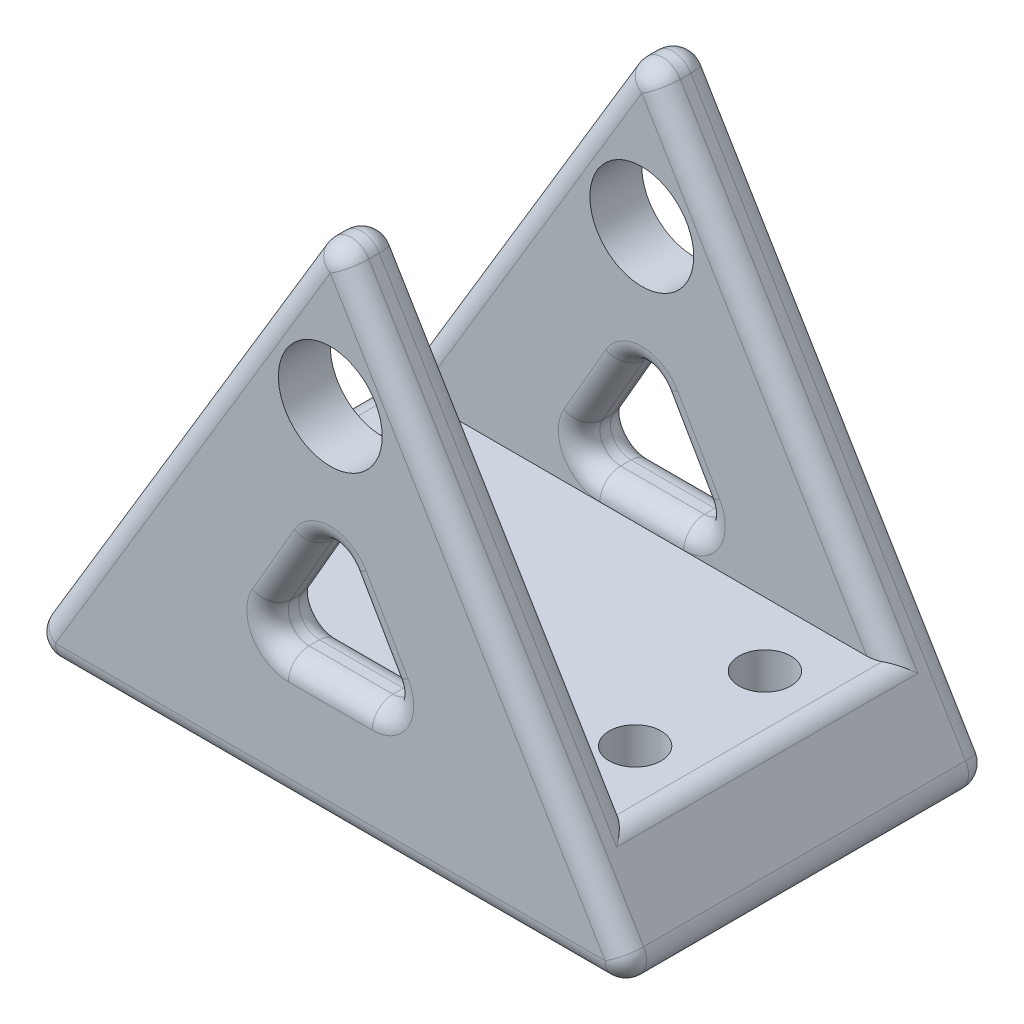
ISO-10303-21;
HEADER;
FILE_DESCRIPTION(('STEP AP214'),'2;1');
FILE_NAME('part.step','',(''),(''),'','','');
FILE_SCHEMA(('AUTOMOTIVE_DESIGN { 1 0 10303 214 1 1 1 1 }'));
ENDSEC;
DATA;
#1=APPLICATION_CONTEXT('core data for automotive mechanical design processes');
#2=APPLICATION_PROTOCOL_DEFINITION('international standard','automotive_design',2000,#1);
#3=PRODUCT_CONTEXT('',#1,'mechanical');
#4=PRODUCT('Part','Part','',(#3));
#5=PRODUCT_RELATED_PRODUCT_CATEGORY('part','',(#4));
#6=PRODUCT_DEFINITION_FORMATION('','',#4);
#7=PRODUCT_DEFINITION_CONTEXT('part definition',#1,'design');
#8=PRODUCT_DEFINITION('design','',#6,#7);
#9=PRODUCT_DEFINITION_SHAPE('','',#8);
#10=(LENGTH_UNIT() NAMED_UNIT(*) SI_UNIT(.MILLI.,.METRE.));
#11=(NAMED_UNIT(*) PLANE_ANGLE_UNIT() SI_UNIT($,.RADIAN.));
#12=(NAMED_UNIT(*) SI_UNIT($,.STERADIAN.) SOLID_ANGLE_UNIT());
#13=UNCERTAINTY_MEASURE_WITH_UNIT(LENGTH_MEASURE(1.E-05),#10,'distance_accuracy_value','');
#14=(GEOMETRIC_REPRESENTATION_CONTEXT(3) GLOBAL_UNCERTAINTY_ASSIGNED_CONTEXT((#13)) GLOBAL_UNIT_ASSIGNED_CONTEXT((#10,
#11,#12)) REPRESENTATION_CONTEXT('',''));
#15=CARTESIAN_POINT('',(0.,0.,0.));
#16=DIRECTION('',(0.,0.,1.));
#17=DIRECTION('',(1.,0.,0.));
#18=AXIS2_PLACEMENT_3D('',#15,#16,#17);
#19=CARTESIAN_POINT('',(-38.1,31.75,6.35000000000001));
#20=DIRECTION('',(0.,0.,-1.));
#21=DIRECTION('',(0.,1.,0.));
#22=AXIS2_PLACEMENT_3D('',#19,#20,#21);
#23=PLANE('',#22);
#24=CARTESIAN_POINT('',(0.,12.7,6.35));
#25=DIRECTION('',(0.,0.,-1.));
#26=DIRECTION('',(0.,1.,0.));
#27=AXIS2_PLACEMENT_3D('',#24,#25,#26);
#28=CIRCLE('',#27,6.35);
#29=CARTESIAN_POINT('',(0.,19.05,6.35));
#30=VERTEX_POINT('',#29);
#31=EDGE_CURVE('E1748',#30,#30,#28,.T.);
#32=ORIENTED_EDGE('',*,*,#31,.T.);
#33=EDGE_LOOP('',(#32));
#34=FACE_BOUND('',#33,.T.);
#35=DIRECTION('',(1.,0.,0.));
#36=VECTOR('',#35,1.);
#37=CARTESIAN_POINT('',(-38.1,-19.05,6.34999999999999));
#38=LINE('',#37,#36);
#39=CARTESIAN_POINT('',(-27.5178764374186,-19.05,6.34999999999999));
#40=VERTEX_POINT('',#39);
#41=CARTESIAN_POINT('',(27.5178764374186,-19.05,6.34999999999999));
#42=VERTEX_POINT('',#41);
#43=EDGE_CURVE('E1763',#40,#42,#38,.T.);
#44=ORIENTED_EDGE('',*,*,#43,.T.);
#45=DIRECTION('',(-0.514495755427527,0.857492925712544,0.));
#46=VECTOR('',#45,1.);
#47=CARTESIAN_POINT('',(-12.2633261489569,47.2520043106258,6.35000000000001));
#48=LINE('',#47,#46);
#49=CARTESIAN_POINT('',(0.,26.8131273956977,6.35000000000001));
#50=VERTEX_POINT('',#49);
#51=EDGE_CURVE('E375',#42,#50,#48,.T.);
#52=ORIENTED_EDGE('',*,*,#51,.T.);
#53=DIRECTION('',(-0.514495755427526,-0.857492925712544,0.));
#54=VECTOR('',#53,1.);
#55=CARTESIAN_POINT('',(-7.90726208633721,13.6343572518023,6.35));
#56=LINE('',#55,#54);
#57=EDGE_CURVE('E372',#50,#40,#56,.T.);
#58=ORIENTED_EDGE('',*,*,#57,.T.);
#59=EDGE_LOOP('',(#44,#52,#58));
#60=FACE_BOUND('',#59,.T.);
#61=CARTESIAN_POINT('',(5.12559094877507,-13.9577839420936,6.35));
#62=DIRECTION('',(0.,0.,-1.));
#63=DIRECTION('',(0.,1.,0.));
#64=AXIS2_PLACEMENT_3D('',#61,#62,#63);
#65=CIRCLE('',#64,5.08);
#66=CARTESIAN_POINT('',(5.12559094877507,-19.0377839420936,6.34999999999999));
#67=VERTEX_POINT('',#66);
#68=CARTESIAN_POINT('',(9.52500000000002,-16.4977839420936,6.35));
#69=VERTEX_POINT('',#68);
#70=EDGE_CURVE('E400',#67,#69,#65,.F.);
#71=ORIENTED_EDGE('',*,*,#70,.F.);
#72=DIRECTION('',(-1.,0.,0.));
#73=VECTOR('',#72,1.);
#74=CARTESIAN_POINT('',(-38.1,-19.0377839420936,6.34999999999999));
#75=LINE('',#74,#73);
#76=CARTESIAN_POINT('',(-5.12559094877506,-19.0377839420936,6.34999999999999));
#77=VERTEX_POINT('',#76);
#78=EDGE_CURVE('E407',#67,#77,#75,.T.);
#79=ORIENTED_EDGE('',*,*,#78,.T.);
#80=CARTESIAN_POINT('',(-5.12559094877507,-13.9577839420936,6.35));
#81=DIRECTION('',(0.,0.,-1.));
#82=DIRECTION('',(0.,1.,0.));
#83=AXIS2_PLACEMENT_3D('',#80,#81,#82);
#84=CIRCLE('',#83,5.08);
#85=CARTESIAN_POINT('',(-9.52500000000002,-16.4977839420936,6.35));
#86=VERTEX_POINT('',#85);
#87=EDGE_CURVE('E404',#86,#77,#84,.F.);
#88=ORIENTED_EDGE('',*,*,#87,.F.);
#89=CARTESIAN_POINT('',(-5.12559094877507,-13.9577839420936,6.35));
#90=DIRECTION('',(0.,0.,-1.));
#91=DIRECTION('',(0.,1.,0.));
#92=AXIS2_PLACEMENT_3D('',#89,#90,#91);
#93=CIRCLE('',#92,5.08);
#94=CARTESIAN_POINT('',(-9.52500000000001,-11.4177839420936,6.35));
#95=VERTEX_POINT('',#94);
#96=EDGE_CURVE('E392',#95,#86,#93,.F.);
#97=ORIENTED_EDGE('',*,*,#96,.F.);
#98=DIRECTION('',(0.500000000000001,0.866025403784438,0.));
#99=VECTOR('',#98,1.);
#100=CARTESIAN_POINT('',(2.02344875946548,8.5847160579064,6.35));
#101=LINE('',#100,#99);
#102=CARTESIAN_POINT('',(-4.39940905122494,-2.54000000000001,6.35));
#103=VERTEX_POINT('',#102);
#104=EDGE_CURVE('E386',#95,#103,#101,.T.);
#105=ORIENTED_EDGE('',*,*,#104,.T.);
#106=CARTESIAN_POINT('',(0.,-5.08000000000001,6.35));
#107=DIRECTION('',(0.,0.,-1.));
#108=DIRECTION('',(0.,1.,0.));
#109=AXIS2_PLACEMENT_3D('',#106,#107,#108);
#110=CIRCLE('',#109,5.08);
#111=CARTESIAN_POINT('',(0.,0.,6.35));
#112=VERTEX_POINT('',#111);
#113=EDGE_CURVE('E378',#112,#103,#110,.F.);
#114=ORIENTED_EDGE('',*,*,#113,.F.);
#115=CARTESIAN_POINT('',(0.,-5.08000000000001,6.35));
#116=DIRECTION('',(0.,0.,-1.));
#117=DIRECTION('',(0.,1.,0.));
#118=AXIS2_PLACEMENT_3D('',#115,#116,#117);
#119=CIRCLE('',#118,5.08);
#120=CARTESIAN_POINT('',(4.39940905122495,-2.54,6.35));
#121=VERTEX_POINT('',#120);
#122=EDGE_CURVE('E382',#121,#112,#119,.F.);
#123=ORIENTED_EDGE('',*,*,#122,.F.);
#124=DIRECTION('',(0.500000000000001,-0.866025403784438,0.));
#125=VECTOR('',#124,1.);
#126=CARTESIAN_POINT('',(-21.0734487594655,41.5802839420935,6.35000000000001));
#127=LINE('',#126,#125);
#128=CARTESIAN_POINT('',(9.52500000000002,-11.4177839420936,6.35));
#129=VERTEX_POINT('',#128);
#130=EDGE_CURVE('E389',#121,#129,#127,.T.);
#131=ORIENTED_EDGE('',*,*,#130,.T.);
#132=CARTESIAN_POINT('',(5.12559094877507,-13.9577839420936,6.35));
#133=DIRECTION('',(0.,0.,-1.));
#134=DIRECTION('',(0.,1.,0.));
#135=AXIS2_PLACEMENT_3D('',#132,#133,#134);
#136=CIRCLE('',#135,5.08);
#137=EDGE_CURVE('E396',#69,#129,#136,.F.);
#138=ORIENTED_EDGE('',*,*,#137,.F.);
#139=EDGE_LOOP('',(#71,#79,#88,#97,#105,#114,#123,#131,#138));
#140=FACE_BOUND('',#139,.T.);
#141=ADVANCED_FACE('F41',(#34,#60,#140),#23,.F.);
#142=CARTESIAN_POINT('',(0.,0.,0.));
#143=DIRECTION('',(0.,0.,1.));
#144=DIRECTION('',(1.,0.,0.));
#145=AXIS2_PLACEMENT_3D('',#142,#143,#144);
#146=PLANE('',#145);
#147=CARTESIAN_POINT('',(0.,12.7,0.));
#148=DIRECTION('',(0.,0.,1.));
#149=DIRECTION('',(1.,0.,0.));
#150=AXIS2_PLACEMENT_3D('',#147,#148,#149);
#151=CIRCLE('',#150,6.35);
#152=CARTESIAN_POINT('',(6.35,12.7,0.));
#153=VERTEX_POINT('',#152);
#154=EDGE_CURVE('E1749',#153,#153,#151,.T.);
#155=ORIENTED_EDGE('',*,*,#154,.T.);
#156=EDGE_LOOP('',(#155));
#157=FACE_BOUND('',#156,.T.);
#158=DIRECTION('',(1.,0.,0.));
#159=VECTOR('',#158,1.);
#160=CARTESIAN_POINT('',(0.,-29.21,0.));
#161=LINE('',#160,#159);
#162=CARTESIAN_POINT('',(33.6138764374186,-29.21,0.));
#163=VERTEX_POINT('',#162);
#164=CARTESIAN_POINT('',(-33.6138764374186,-29.21,0.));
#165=VERTEX_POINT('',#164);
#166=EDGE_CURVE('E788',#163,#165,#161,.F.);
#167=ORIENTED_EDGE('',*,*,#166,.T.);
#168=DIRECTION('',(0.514495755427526,0.857492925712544,0.));
#169=VECTOR('',#168,1.);
#170=CARTESIAN_POINT('',(-11.8293209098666,7.09759254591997,0.));
#171=LINE('',#170,#169);
#172=CARTESIAN_POINT('',(0.,26.8131273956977,0.));
#173=VERTEX_POINT('',#172);
#174=EDGE_CURVE('E794',#165,#173,#171,.T.);
#175=ORIENTED_EDGE('',*,*,#174,.T.);
#176=DIRECTION('',(0.514495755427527,-0.857492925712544,0.));
#177=VECTOR('',#176,1.);
#178=CARTESIAN_POINT('',(11.8293209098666,7.09759254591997,0.));
#179=LINE('',#178,#177);
#180=EDGE_CURVE('E791',#173,#163,#179,.T.);
#181=ORIENTED_EDGE('',*,*,#180,.T.);
#182=EDGE_LOOP('',(#167,#175,#181));
#183=FACE_BOUND('',#182,.T.);
#184=CARTESIAN_POINT('',(0.,-5.08000000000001,0.));
#185=DIRECTION('',(0.,0.,1.));
#186=DIRECTION('',(1.,0.,0.));
#187=AXIS2_PLACEMENT_3D('',#184,#185,#186);
#188=CIRCLE('',#187,5.08);
#189=CARTESIAN_POINT('',(-4.39940905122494,-2.54,0.));
#190=VERTEX_POINT('',#189);
#191=CARTESIAN_POINT('',(0.,0.,0.));
#192=VERTEX_POINT('',#191);
#193=EDGE_CURVE('E348',#190,#192,#188,.F.);
#194=ORIENTED_EDGE('',*,*,#193,.F.);
#195=DIRECTION('',(-0.500000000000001,-0.866025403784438,0.));
#196=VECTOR('',#195,1.);
#197=CARTESIAN_POINT('',(-2.19970452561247,1.27,0.));
#198=LINE('',#197,#196);
#199=CARTESIAN_POINT('',(-9.52500000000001,-11.4177839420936,0.));
#200=VERTEX_POINT('',#199);
#201=EDGE_CURVE('E356',#190,#200,#198,.T.);
#202=ORIENTED_EDGE('',*,*,#201,.T.);
#203=CARTESIAN_POINT('',(-5.12559094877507,-13.9577839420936,0.));
#204=DIRECTION('',(0.,0.,1.));
#205=DIRECTION('',(1.,0.,0.));
#206=AXIS2_PLACEMENT_3D('',#203,#204,#205);
#207=CIRCLE('',#206,5.08);
#208=CARTESIAN_POINT('',(-9.52500000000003,-16.4977839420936,0.));
#209=VERTEX_POINT('',#208);
#210=EDGE_CURVE('E814',#209,#200,#207,.F.);
#211=ORIENTED_EDGE('',*,*,#210,.F.);
#212=CARTESIAN_POINT('',(-5.12559094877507,-13.9577839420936,0.));
#213=DIRECTION('',(0.,0.,1.));
#214=DIRECTION('',(1.,0.,0.));
#215=AXIS2_PLACEMENT_3D('',#212,#213,#214);
#216=CIRCLE('',#215,5.08);
#217=CARTESIAN_POINT('',(-5.12559094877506,-19.0377839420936,0.));
#218=VERTEX_POINT('',#217);
#219=EDGE_CURVE('E808',#218,#209,#216,.F.);
#220=ORIENTED_EDGE('',*,*,#219,.F.);
#221=DIRECTION('',(1.,0.,0.));
#222=VECTOR('',#221,1.);
#223=CARTESIAN_POINT('',(0.,-19.0377839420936,0.));
#224=LINE('',#223,#222);
#225=CARTESIAN_POINT('',(5.12559094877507,-19.0377839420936,0.));
#226=VERTEX_POINT('',#225);
#227=EDGE_CURVE('E805',#218,#226,#224,.T.);
#228=ORIENTED_EDGE('',*,*,#227,.T.);
#229=CARTESIAN_POINT('',(5.12559094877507,-13.9577839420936,0.));
#230=DIRECTION('',(0.,0.,1.));
#231=DIRECTION('',(1.,0.,0.));
#232=AXIS2_PLACEMENT_3D('',#229,#230,#231);
#233=CIRCLE('',#232,5.08);
#234=CARTESIAN_POINT('',(9.52500000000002,-16.4977839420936,0.));
#235=VERTEX_POINT('',#234);
#236=EDGE_CURVE('E797',#235,#226,#233,.F.);
#237=ORIENTED_EDGE('',*,*,#236,.F.);
#238=CARTESIAN_POINT('',(5.12559094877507,-13.9577839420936,0.));
#239=DIRECTION('',(0.,0.,1.));
#240=DIRECTION('',(1.,0.,0.));
#241=AXIS2_PLACEMENT_3D('',#238,#239,#240);
#242=CIRCLE('',#241,5.08);
#243=CARTESIAN_POINT('',(9.52500000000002,-11.4177839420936,0.));
#244=VERTEX_POINT('',#243);
#245=EDGE_CURVE('E801',#244,#235,#242,.F.);
#246=ORIENTED_EDGE('',*,*,#245,.F.);
#247=DIRECTION('',(-0.500000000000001,0.866025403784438,0.));
#248=VECTOR('',#247,1.);
#249=CARTESIAN_POINT('',(2.19970452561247,1.27,0.));
#250=LINE('',#249,#248);
#251=CARTESIAN_POINT('',(4.39940905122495,-2.54,0.));
#252=VERTEX_POINT('',#251);
#253=EDGE_CURVE('E351',#244,#252,#250,.T.);
#254=ORIENTED_EDGE('',*,*,#253,.T.);
#255=CARTESIAN_POINT('',(0.,-5.08000000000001,0.));
#256=DIRECTION('',(0.,0.,1.));
#257=DIRECTION('',(1.,0.,0.));
#258=AXIS2_PLACEMENT_3D('',#255,#256,#257);
#259=CIRCLE('',#258,5.08);
#260=EDGE_CURVE('E345',#192,#252,#259,.F.);
#261=ORIENTED_EDGE('',*,*,#260,.F.);
#262=EDGE_LOOP('',(#194,#202,#211,#220,#228,#237,#246,#254,#261));
#263=FACE_BOUND('',#262,.T.);
#264=ADVANCED_FACE('F347',(#157,#183,#263),#146,.F.);
#265=CARTESIAN_POINT('',(0.,0.,44.45));
#266=DIRECTION('',(0.,0.,1.));
#267=DIRECTION('',(1.,0.,0.));
#268=AXIS2_PLACEMENT_3D('',#265,#266,#267);
#269=PLANE('',#268);
#270=CARTESIAN_POINT('',(0.,12.7,44.45));
#271=DIRECTION('',(0.,0.,1.));
#272=DIRECTION('',(1.,0.,0.));
#273=AXIS2_PLACEMENT_3D('',#270,#271,#272);
#274=CIRCLE('',#273,6.35);
#275=CARTESIAN_POINT('',(6.35,12.7,44.45));
#276=VERTEX_POINT('',#275);
#277=EDGE_CURVE('E500',#276,#276,#274,.T.);
#278=ORIENTED_EDGE('',*,*,#277,.F.);
#279=EDGE_LOOP('',(#278));
#280=FACE_BOUND('',#279,.T.);
#281=DIRECTION('',(1.,0.,0.));
#282=VECTOR('',#281,1.);
#283=CARTESIAN_POINT('',(38.1,-29.21,44.45));
#284=LINE('',#283,#282);
#285=CARTESIAN_POINT('',(-33.6138764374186,-29.21,44.45));
#286=VERTEX_POINT('',#285);
#287=CARTESIAN_POINT('',(33.6138764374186,-29.21,44.45));
#288=VERTEX_POINT('',#287);
#289=EDGE_CURVE('E744',#286,#288,#284,.T.);
#290=ORIENTED_EDGE('',*,*,#289,.T.);
#291=DIRECTION('',(0.514495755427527,-0.857492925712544,0.));
#292=VECTOR('',#291,1.);
#293=CARTESIAN_POINT('',(-2.17803203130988,30.4431807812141,44.45));
#294=LINE('',#293,#292);
#295=CARTESIAN_POINT('',(0.,26.8131273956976,44.45));
#296=VERTEX_POINT('',#295);
#297=EDGE_CURVE('E750',#288,#296,#294,.F.);
#298=ORIENTED_EDGE('',*,*,#297,.T.);
#299=DIRECTION('',(0.514495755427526,0.857492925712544,0.));
#300=VECTOR('',#299,1.);
#301=CARTESIAN_POINT('',(-35.9219679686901,-33.0568192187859,44.45));
#302=LINE('',#301,#300);
#303=EDGE_CURVE('E747',#296,#286,#302,.F.);
#304=ORIENTED_EDGE('',*,*,#303,.T.);
#305=EDGE_LOOP('',(#290,#298,#304));
#306=FACE_BOUND('',#305,.T.);
#307=CARTESIAN_POINT('',(0.,-5.08000000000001,44.45));
#308=DIRECTION('',(0.,0.,1.));
#309=DIRECTION('',(1.,0.,0.));
#310=AXIS2_PLACEMENT_3D('',#307,#308,#309);
#311=CIRCLE('',#310,5.08);
#312=CARTESIAN_POINT('',(4.39940905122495,-2.54,44.45));
#313=VERTEX_POINT('',#312);
#314=CARTESIAN_POINT('',(0.,0.,44.45));
#315=VERTEX_POINT('',#314);
#316=EDGE_CURVE('E784',#313,#315,#311,.T.);
#317=ORIENTED_EDGE('',*,*,#316,.F.);
#318=DIRECTION('',(-0.500000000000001,0.866025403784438,0.));
#319=VECTOR('',#318,1.);
#320=CARTESIAN_POINT('',(11.7247045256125,-15.2277839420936,44.45));
#321=LINE('',#320,#319);
#322=CARTESIAN_POINT('',(9.52500000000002,-11.4177839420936,44.45));
#323=VERTEX_POINT('',#322);
#324=EDGE_CURVE('E777',#313,#323,#321,.F.);
#325=ORIENTED_EDGE('',*,*,#324,.T.);
#326=CARTESIAN_POINT('',(5.12559094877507,-13.9577839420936,44.45));
#327=DIRECTION('',(0.,0.,1.));
#328=DIRECTION('',(1.,0.,0.));
#329=AXIS2_PLACEMENT_3D('',#326,#327,#328);
#330=CIRCLE('',#329,5.08);
#331=CARTESIAN_POINT('',(9.52500000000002,-16.4977839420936,44.45));
#332=VERTEX_POINT('',#331);
#333=EDGE_CURVE('E773',#332,#323,#330,.T.);
#334=ORIENTED_EDGE('',*,*,#333,.F.);
#335=CARTESIAN_POINT('',(5.12559094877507,-13.9577839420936,44.45));
#336=DIRECTION('',(0.,0.,1.));
#337=DIRECTION('',(1.,0.,0.));
#338=AXIS2_PLACEMENT_3D('',#335,#336,#337);
#339=CIRCLE('',#338,5.08);
#340=CARTESIAN_POINT('',(5.12559094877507,-19.0377839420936,44.45));
#341=VERTEX_POINT('',#340);
#342=EDGE_CURVE('E765',#341,#332,#339,.T.);
#343=ORIENTED_EDGE('',*,*,#342,.F.);
#344=DIRECTION('',(1.,0.,0.));
#345=VECTOR('',#344,1.);
#346=CARTESIAN_POINT('',(-9.52500000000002,-19.0377839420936,44.45));
#347=LINE('',#346,#345);
#348=CARTESIAN_POINT('',(-5.12559094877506,-19.0377839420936,44.45));
#349=VERTEX_POINT('',#348);
#350=EDGE_CURVE('E762',#341,#349,#347,.F.);
#351=ORIENTED_EDGE('',*,*,#350,.T.);
#352=CARTESIAN_POINT('',(-5.12559094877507,-13.9577839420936,44.45));
#353=DIRECTION('',(0.,0.,1.));
#354=DIRECTION('',(1.,0.,0.));
#355=AXIS2_PLACEMENT_3D('',#352,#353,#354);
#356=CIRCLE('',#355,5.08);
#357=CARTESIAN_POINT('',(-9.52500000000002,-16.4977839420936,44.45));
#358=VERTEX_POINT('',#357);
#359=EDGE_CURVE('E754',#358,#349,#356,.T.);
#360=ORIENTED_EDGE('',*,*,#359,.F.);
#361=CARTESIAN_POINT('',(-5.12559094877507,-13.9577839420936,44.45));
#362=DIRECTION('',(0.,0.,1.));
#363=DIRECTION('',(1.,0.,0.));
#364=AXIS2_PLACEMENT_3D('',#361,#362,#363);
#365=CIRCLE('',#364,5.08);
#366=CARTESIAN_POINT('',(-9.52500000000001,-11.4177839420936,44.45));
#367=VERTEX_POINT('',#366);
#368=EDGE_CURVE('E758',#367,#358,#365,.T.);
#369=ORIENTED_EDGE('',*,*,#368,.F.);
#370=DIRECTION('',(-0.500000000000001,-0.866025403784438,0.));
#371=VECTOR('',#370,1.);
#372=CARTESIAN_POINT('',(-2.19970452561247,1.26999999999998,44.45));
#373=LINE('',#372,#371);
#374=CARTESIAN_POINT('',(-4.39940905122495,-2.54,44.45));
#375=VERTEX_POINT('',#374);
#376=EDGE_CURVE('E769',#367,#375,#373,.F.);
#377=ORIENTED_EDGE('',*,*,#376,.T.);
#378=CARTESIAN_POINT('',(0.,-5.08000000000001,44.45));
#379=DIRECTION('',(0.,0.,1.));
#380=DIRECTION('',(1.,0.,0.));
#381=AXIS2_PLACEMENT_3D('',#378,#379,#380);
#382=CIRCLE('',#381,5.08);
#383=EDGE_CURVE('E780',#315,#375,#382,.T.);
#384=ORIENTED_EDGE('',*,*,#383,.F.);
#385=EDGE_LOOP('',(#317,#325,#334,#343,#351,#360,#369,#377,#384));
#386=FACE_BOUND('',#385,.T.);
#387=ADVANCED_FACE('F1026',(#280,#306,#386),#269,.T.);
#388=CARTESIAN_POINT('',(-38.1,-19.05,38.1));
#389=DIRECTION('',(0.,0.,1.));
#390=DIRECTION('',(0.,-1.,0.));
#391=AXIS2_PLACEMENT_3D('',#388,#389,#390);
#392=PLANE('',#391);
#393=DIRECTION('',(0.514495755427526,0.857492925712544,0.));
#394=VECTOR('',#393,1.);
#395=CARTESIAN_POINT('',(-30.3190267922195,-23.7185839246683,38.1));
#396=LINE('',#395,#394);
#397=CARTESIAN_POINT('',(-27.5178764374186,-19.05,38.1));
#398=VERTEX_POINT('',#397);
#399=CARTESIAN_POINT('',(0.,26.8131273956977,38.1));
#400=VERTEX_POINT('',#399);
#401=EDGE_CURVE('E699',#398,#400,#396,.T.);
#402=ORIENTED_EDGE('',*,*,#401,.T.);
#403=DIRECTION('',(0.514495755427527,-0.857492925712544,0.));
#404=VECTOR('',#403,1.);
#405=CARTESIAN_POINT('',(10.1484385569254,9.89906313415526,38.1));
#406=LINE('',#405,#404);
#407=CARTESIAN_POINT('',(27.5178764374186,-19.05,38.1));
#408=VERTEX_POINT('',#407);
#409=EDGE_CURVE('E707',#400,#408,#406,.T.);
#410=ORIENTED_EDGE('',*,*,#409,.T.);
#411=DIRECTION('',(1.,0.,0.));
#412=VECTOR('',#411,1.);
#413=CARTESIAN_POINT('',(-38.1,-19.05,38.1));
#414=LINE('',#413,#412);
#415=EDGE_CURVE('E1759',#398,#408,#414,.T.);
#416=ORIENTED_EDGE('',*,*,#415,.F.);
#417=EDGE_LOOP('',(#402,#410,#416));
#418=FACE_BOUND('',#417,.T.);
#419=CARTESIAN_POINT('',(0.,12.7,38.1));
#420=DIRECTION('',(0.,0.,1.));
#421=DIRECTION('',(0.,-1.,0.));
#422=AXIS2_PLACEMENT_3D('',#419,#420,#421);
#423=CIRCLE('',#422,6.35);
#424=CARTESIAN_POINT('',(0.,6.34999999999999,38.1));
#425=VERTEX_POINT('',#424);
#426=EDGE_CURVE('E1708',#425,#425,#423,.T.);
#427=ORIENTED_EDGE('',*,*,#426,.T.);
#428=EDGE_LOOP('',(#427));
#429=FACE_BOUND('',#428,.T.);
#430=CARTESIAN_POINT('',(-5.12559094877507,-13.9577839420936,38.1));
#431=DIRECTION('',(0.,0.,1.));
#432=DIRECTION('',(0.,-1.,0.));
#433=AXIS2_PLACEMENT_3D('',#430,#431,#432);
#434=CIRCLE('',#433,5.08);
#435=CARTESIAN_POINT('',(-5.12559094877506,-19.0377839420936,38.1));
#436=VERTEX_POINT('',#435);
#437=CARTESIAN_POINT('',(-9.52500000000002,-16.4977839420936,38.1));
#438=VERTEX_POINT('',#437);
#439=EDGE_CURVE('E740',#436,#438,#434,.F.);
#440=ORIENTED_EDGE('',*,*,#439,.F.);
#441=DIRECTION('',(1.,0.,0.));
#442=VECTOR('',#441,1.);
#443=CARTESIAN_POINT('',(-38.1,-19.0377839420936,38.1));
#444=LINE('',#443,#442);
#445=CARTESIAN_POINT('',(5.12559094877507,-19.0377839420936,38.1));
#446=VERTEX_POINT('',#445);
#447=EDGE_CURVE('E734',#436,#446,#444,.T.);
#448=ORIENTED_EDGE('',*,*,#447,.T.);
#449=CARTESIAN_POINT('',(5.12559094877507,-13.9577839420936,38.1));
#450=DIRECTION('',(0.,0.,1.));
#451=DIRECTION('',(0.,-1.,0.));
#452=AXIS2_PLACEMENT_3D('',#449,#450,#451);
#453=CIRCLE('',#452,5.08);
#454=CARTESIAN_POINT('',(9.52500000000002,-16.4977839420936,38.1));
#455=VERTEX_POINT('',#454);
#456=EDGE_CURVE('E730',#455,#446,#453,.F.);
#457=ORIENTED_EDGE('',*,*,#456,.F.);
#458=CARTESIAN_POINT('',(5.12559094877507,-13.9577839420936,38.1));
#459=DIRECTION('',(0.,0.,1.));
#460=DIRECTION('',(0.,-1.,0.));
#461=AXIS2_PLACEMENT_3D('',#458,#459,#460);
#462=CIRCLE('',#461,5.08);
#463=CARTESIAN_POINT('',(9.52500000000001,-11.4177839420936,38.1));
#464=VERTEX_POINT('',#463);
#465=EDGE_CURVE('E722',#464,#455,#462,.F.);
#466=ORIENTED_EDGE('',*,*,#465,.F.);
#467=DIRECTION('',(-0.500000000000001,0.866025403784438,0.));
#468=VECTOR('',#467,1.);
#469=CARTESIAN_POINT('',(0.92359649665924,3.48028394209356,38.1));
#470=LINE('',#469,#468);
#471=CARTESIAN_POINT('',(4.39940905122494,-2.54000000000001,38.1));
#472=VERTEX_POINT('',#471);
#473=EDGE_CURVE('E719',#464,#472,#470,.T.);
#474=ORIENTED_EDGE('',*,*,#473,.T.);
#475=CARTESIAN_POINT('',(0.,-5.08000000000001,38.1));
#476=DIRECTION('',(0.,0.,1.));
#477=DIRECTION('',(0.,-1.,0.));
#478=AXIS2_PLACEMENT_3D('',#475,#476,#477);
#479=CIRCLE('',#478,5.08);
#480=CARTESIAN_POINT('',(0.,0.,38.1));
#481=VERTEX_POINT('',#480);
#482=EDGE_CURVE('E711',#481,#472,#479,.F.);
#483=ORIENTED_EDGE('',*,*,#482,.F.);
#484=CARTESIAN_POINT('',(0.,-5.08000000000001,38.1));
#485=DIRECTION('',(0.,0.,1.));
#486=DIRECTION('',(0.,-1.,0.));
#487=AXIS2_PLACEMENT_3D('',#484,#485,#486);
#488=CIRCLE('',#487,5.08);
#489=CARTESIAN_POINT('',(-4.39940905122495,-2.54,38.1));
#490=VERTEX_POINT('',#489);
#491=EDGE_CURVE('E715',#490,#481,#488,.F.);
#492=ORIENTED_EDGE('',*,*,#491,.F.);
#493=DIRECTION('',(-0.5,-0.866025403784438,0.));
#494=VECTOR('',#493,1.);
#495=CARTESIAN_POINT('',(-19.9735964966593,-29.5152839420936,38.1));
#496=LINE('',#495,#494);
#497=CARTESIAN_POINT('',(-9.52500000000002,-11.4177839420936,38.1));
#498=VERTEX_POINT('',#497);
#499=EDGE_CURVE('E726',#490,#498,#496,.T.);
#500=ORIENTED_EDGE('',*,*,#499,.T.);
#501=CARTESIAN_POINT('',(-5.12559094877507,-13.9577839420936,38.1));
#502=DIRECTION('',(0.,0.,1.));
#503=DIRECTION('',(0.,-1.,0.));
#504=AXIS2_PLACEMENT_3D('',#501,#502,#503);
#505=CIRCLE('',#504,5.08);
#506=EDGE_CURVE('E737',#438,#498,#505,.F.);
#507=ORIENTED_EDGE('',*,*,#506,.F.);
#508=EDGE_LOOP('',(#440,#448,#457,#466,#474,#483,#492,#500,#507));
#509=FACE_BOUND('',#508,.T.);
#510=ADVANCED_FACE('F1033',(#418,#429,#509),#392,.F.);
#511=CARTESIAN_POINT('',(-38.1,-31.75,44.45));
#512=DIRECTION('',(0.,1.,0.));
#513=DIRECTION('',(0.,0.,1.));
#514=AXIS2_PLACEMENT_3D('',#511,#512,#513);
#515=PLANE('',#514);
#516=DIRECTION('',(1.,0.,0.));
#517=VECTOR('',#516,1.);
#518=CARTESIAN_POINT('',(-38.1,-31.75,41.91));
#519=LINE('',#518,#517);
#520=CARTESIAN_POINT('',(33.6138764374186,-31.75,41.91));
#521=VERTEX_POINT('',#520);
#522=CARTESIAN_POINT('',(-33.6138764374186,-31.75,41.91));
#523=VERTEX_POINT('',#522);
#524=EDGE_CURVE('E411',#521,#523,#519,.F.);
#525=ORIENTED_EDGE('',*,*,#524,.T.);
#526=DIRECTION('',(0.,0.,-1.));
#527=VECTOR('',#526,1.);
#528=CARTESIAN_POINT('',(-33.6138764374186,-31.75,44.45));
#529=LINE('',#528,#527);
#530=CARTESIAN_POINT('',(-33.6138764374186,-31.75,2.54));
#531=VERTEX_POINT('',#530);
#532=EDGE_CURVE('E420',#523,#531,#529,.T.);
#533=ORIENTED_EDGE('',*,*,#532,.T.);
#534=DIRECTION('',(1.,0.,0.));
#535=VECTOR('',#534,1.);
#536=CARTESIAN_POINT('',(-38.1,-31.75,2.54));
#537=LINE('',#536,#535);
#538=CARTESIAN_POINT('',(33.6138764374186,-31.75,2.54));
#539=VERTEX_POINT('',#538);
#540=EDGE_CURVE('E417',#531,#539,#537,.T.);
#541=ORIENTED_EDGE('',*,*,#540,.T.);
#542=DIRECTION('',(0.,0.,-1.));
#543=VECTOR('',#542,1.);
#544=CARTESIAN_POINT('',(33.6138764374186,-31.75,44.45));
#545=LINE('',#544,#543);
#546=EDGE_CURVE('E414',#539,#521,#545,.F.);
#547=ORIENTED_EDGE('',*,*,#546,.T.);
#548=EDGE_LOOP('',(#525,#533,#541,#547));
#549=FACE_BOUND('',#548,.T.);
#550=CARTESIAN_POINT('',(-22.86,-31.75,30.0245332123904));
#551=DIRECTION('',(0.,1.,0.));
#552=DIRECTION('',(0.,0.,1.));
#553=AXIS2_PLACEMENT_3D('',#550,#551,#552);
#554=CIRCLE('',#553,3.17499999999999);
#555=CARTESIAN_POINT('',(-22.86,-31.75,33.1995332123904));
#556=VERTEX_POINT('',#555);
#557=EDGE_CURVE('E1800',#556,#556,#554,.T.);
#558=ORIENTED_EDGE('',*,*,#557,.T.);
#559=EDGE_LOOP('',(#558));
#560=FACE_BOUND('',#559,.T.);
#561=CARTESIAN_POINT('',(22.86,-31.75,30.0245332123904));
#562=DIRECTION('',(0.,1.,0.));
#563=DIRECTION('',(0.,0.,1.));
#564=AXIS2_PLACEMENT_3D('',#561,#562,#563);
#565=CIRCLE('',#564,3.175);
#566=CARTESIAN_POINT('',(22.86,-31.75,33.1995332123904));
#567=VERTEX_POINT('',#566);
#568=EDGE_CURVE('E1803',#567,#567,#565,.T.);
#569=ORIENTED_EDGE('',*,*,#568,.T.);
#570=EDGE_LOOP('',(#569));
#571=FACE_BOUND('',#570,.T.);
#572=CARTESIAN_POINT('',(22.86,-31.75,14.1495332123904));
#573=DIRECTION('',(0.,1.,0.));
#574=DIRECTION('',(0.,0.,1.));
#575=AXIS2_PLACEMENT_3D('',#572,#573,#574);
#576=CIRCLE('',#575,3.175);
#577=CARTESIAN_POINT('',(22.86,-31.75,17.3245332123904));
#578=VERTEX_POINT('',#577);
#579=EDGE_CURVE('E1807',#578,#578,#576,.T.);
#580=ORIENTED_EDGE('',*,*,#579,.T.);
#581=EDGE_LOOP('',(#580));
#582=FACE_BOUND('',#581,.T.);
#583=CARTESIAN_POINT('',(-22.86,-31.75,14.1495332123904));
#584=DIRECTION('',(0.,1.,0.));
#585=DIRECTION('',(0.,0.,1.));
#586=AXIS2_PLACEMENT_3D('',#583,#584,#585);
#587=CIRCLE('',#586,3.175);
#588=CARTESIAN_POINT('',(-22.86,-31.75,17.3245332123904));
#589=VERTEX_POINT('',#588);
#590=EDGE_CURVE('E1811',#589,#589,#587,.T.);
#591=ORIENTED_EDGE('',*,*,#590,.T.);
#592=EDGE_LOOP('',(#591));
#593=FACE_BOUND('',#592,.T.);
#594=ADVANCED_FACE('F1002',(#549,#560,#571,#582,#593),#515,.F.);
#595=CARTESIAN_POINT('',(-38.1,-19.05,38.1));
#596=DIRECTION('',(0.,-1.,0.));
#597=DIRECTION('',(1.,0.,0.));
#598=AXIS2_PLACEMENT_3D('',#595,#596,#597);
#599=PLANE('',#598);
#600=CARTESIAN_POINT('',(-22.86,-19.05,30.0245332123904));
#601=DIRECTION('',(0.,1.,0.));
#602=DIRECTION('',(1.,0.,0.));
#603=AXIS2_PLACEMENT_3D('',#600,#601,#602);
#604=CIRCLE('',#603,3.17499999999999);
#605=CARTESIAN_POINT('',(-19.685,-19.05,30.0245332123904));
#606=VERTEX_POINT('',#605);
#607=EDGE_CURVE('E1754',#606,#606,#604,.T.);
#608=ORIENTED_EDGE('',*,*,#607,.F.);
#609=EDGE_LOOP('',(#608));
#610=FACE_BOUND('',#609,.T.);
#611=CARTESIAN_POINT('',(22.86,-19.05,30.0245332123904));
#612=DIRECTION('',(0.,1.,0.));
#613=DIRECTION('',(-1.,0.,0.));
#614=AXIS2_PLACEMENT_3D('',#611,#612,#613);
#615=CIRCLE('',#614,3.175);
#616=CARTESIAN_POINT('',(19.685,-19.05,30.0245332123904));
#617=VERTEX_POINT('',#616);
#618=EDGE_CURVE('E1823',#617,#617,#615,.T.);
#619=ORIENTED_EDGE('',*,*,#618,.F.);
#620=EDGE_LOOP('',(#619));
#621=FACE_BOUND('',#620,.T.);
#622=CARTESIAN_POINT('',(22.86,-19.05,14.1495332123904));
#623=DIRECTION('',(0.,1.,0.));
#624=DIRECTION('',(1.,0.,0.));
#625=AXIS2_PLACEMENT_3D('',#622,#623,#624);
#626=CIRCLE('',#625,3.175);
#627=CARTESIAN_POINT('',(26.035,-19.05,14.1495332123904));
#628=VERTEX_POINT('',#627);
#629=EDGE_CURVE('E1819',#628,#628,#626,.T.);
#630=ORIENTED_EDGE('',*,*,#629,.F.);
#631=EDGE_LOOP('',(#630));
#632=FACE_BOUND('',#631,.T.);
#633=CARTESIAN_POINT('',(-22.86,-19.05,14.1495332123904));
#634=DIRECTION('',(0.,1.,0.));
#635=DIRECTION('',(-1.,0.,0.));
#636=AXIS2_PLACEMENT_3D('',#633,#634,#635);
#637=CIRCLE('',#636,3.175);
#638=CARTESIAN_POINT('',(-26.035,-19.05,14.1495332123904));
#639=VERTEX_POINT('',#638);
#640=EDGE_CURVE('E1815',#639,#639,#637,.T.);
#641=ORIENTED_EDGE('',*,*,#640,.F.);
#642=EDGE_LOOP('',(#641));
#643=FACE_BOUND('',#642,.T.);
#644=CARTESIAN_POINT('',(27.5178764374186,-19.05,40.64));
#645=DIRECTION('',(0.,-1.,0.));
#646=DIRECTION('',(1.,0.,0.));
#647=AXIS2_PLACEMENT_3D('',#644,#645,#646);
#648=ELLIPSE('',#647,2.96212356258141,2.54);
#649=CARTESIAN_POINT('',(29.0418764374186,-19.05,38.4619679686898));
#650=VERTEX_POINT('',#649);
#651=EDGE_CURVE('E424',#408,#650,#648,.T.);
#652=ORIENTED_EDGE('',*,*,#651,.T.);
#653=DIRECTION('',(0.,0.,-1.));
#654=VECTOR('',#653,1.);
#655=CARTESIAN_POINT('',(29.0418764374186,-19.05,38.1));
#656=LINE('',#655,#654);
#657=CARTESIAN_POINT('',(29.0418764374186,-19.05,5.98803203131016));
#658=VERTEX_POINT('',#657);
#659=EDGE_CURVE('E366',#650,#658,#656,.T.);
#660=ORIENTED_EDGE('',*,*,#659,.T.);
#661=CARTESIAN_POINT('',(27.5178764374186,-19.05,3.80999999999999));
#662=DIRECTION('',(0.,-1.,0.));
#663=DIRECTION('',(-1.,0.,0.));
#664=AXIS2_PLACEMENT_3D('',#661,#662,#663);
#665=ELLIPSE('',#664,2.96212356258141,2.54);
#666=EDGE_CURVE('E428',#658,#42,#665,.T.);
#667=ORIENTED_EDGE('',*,*,#666,.T.);
#668=ORIENTED_EDGE('',*,*,#43,.F.);
#669=CARTESIAN_POINT('',(-27.5178764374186,-19.05,3.80999999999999));
#670=DIRECTION('',(0.,-1.,0.));
#671=DIRECTION('',(-1.,0.,0.));
#672=AXIS2_PLACEMENT_3D('',#669,#670,#671);
#673=ELLIPSE('',#672,2.96212356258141,2.54);
#674=CARTESIAN_POINT('',(-29.0418764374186,-19.05,5.98803203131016));
#675=VERTEX_POINT('',#674);
#676=EDGE_CURVE('E51',#40,#675,#673,.T.);
#677=ORIENTED_EDGE('',*,*,#676,.T.);
#678=DIRECTION('',(0.,0.,1.));
#679=VECTOR('',#678,1.);
#680=CARTESIAN_POINT('',(-29.0418764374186,-19.05,38.1));
#681=LINE('',#680,#679);
#682=CARTESIAN_POINT('',(-29.0418764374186,-19.05,38.4619679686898));
#683=VERTEX_POINT('',#682);
#684=EDGE_CURVE('E58',#675,#683,#681,.T.);
#685=ORIENTED_EDGE('',*,*,#684,.T.);
#686=CARTESIAN_POINT('',(-27.5178764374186,-19.05,40.64));
#687=DIRECTION('',(0.,-1.,0.));
#688=DIRECTION('',(1.,0.,0.));
#689=AXIS2_PLACEMENT_3D('',#686,#687,#688);
#690=ELLIPSE('',#689,2.96212356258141,2.54);
#691=EDGE_CURVE('E11',#683,#398,#690,.T.);
#692=ORIENTED_EDGE('',*,*,#691,.T.);
#693=ORIENTED_EDGE('',*,*,#415,.T.);
#694=EDGE_LOOP('',(#652,#660,#667,#668,#677,#685,#692,#693));
#695=FACE_BOUND('',#694,.T.);
#696=ADVANCED_FACE('F1043',(#610,#621,#632,#643,#695),#599,.F.);
#697=CARTESIAN_POINT('',(-38.1,-31.75,0.));
#698=DIRECTION('',(0.857492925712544,-0.514495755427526,0.));
#699=DIRECTION('',(0.514495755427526,0.857492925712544,0.));
#700=AXIS2_PLACEMENT_3D('',#697,#698,#699);
#701=PLANE('',#700);
#702=DIRECTION('',(0.514495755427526,0.857492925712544,0.));
#703=VECTOR('',#702,1.);
#704=CARTESIAN_POINT('',(-38.1,-31.75,2.54));
#705=LINE('',#704,#703);
#706=CARTESIAN_POINT('',(-2.17803203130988,28.1199466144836,2.54));
#707=VERTEX_POINT('',#706);
#708=CARTESIAN_POINT('',(-35.7919084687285,-27.9031807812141,2.54));
#709=VERTEX_POINT('',#708);
#710=EDGE_CURVE('E689',#707,#709,#705,.F.);
#711=ORIENTED_EDGE('',*,*,#710,.T.);
#712=DIRECTION('',(0.,0.,-1.));
#713=VECTOR('',#712,1.);
#714=CARTESIAN_POINT('',(-35.7919084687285,-27.9031807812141,0.));
#715=LINE('',#714,#713);
#716=CARTESIAN_POINT('',(-35.7919084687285,-27.9031807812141,41.91));
#717=VERTEX_POINT('',#716);
#718=EDGE_CURVE('E694',#709,#717,#715,.F.);
#719=ORIENTED_EDGE('',*,*,#718,.T.);
#720=DIRECTION('',(0.514495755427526,0.857492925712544,0.));
#721=VECTOR('',#720,1.);
#722=CARTESIAN_POINT('',(0.,31.75,41.91));
#723=LINE('',#722,#721);
#724=CARTESIAN_POINT('',(-2.17803203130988,28.1199466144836,41.91));
#725=VERTEX_POINT('',#724);
#726=EDGE_CURVE('E695',#717,#725,#723,.T.);
#727=ORIENTED_EDGE('',*,*,#726,.T.);
#728=DIRECTION('',(0.,0.,1.));
#729=VECTOR('',#728,1.);
#730=CARTESIAN_POINT('',(-2.17803203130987,28.1199466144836,0.));
#731=LINE('',#730,#729);
#732=CARTESIAN_POINT('',(-2.17803203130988,28.1199466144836,40.64));
#733=VERTEX_POINT('',#732);
#734=EDGE_CURVE('E701',#725,#733,#731,.F.);
#735=ORIENTED_EDGE('',*,*,#734,.T.);
#736=DIRECTION('',(0.514495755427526,0.857492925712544,0.));
#737=VECTOR('',#736,1.);
#738=CARTESIAN_POINT('',(-38.1,-31.75,40.64));
#739=LINE('',#738,#737);
#740=CARTESIAN_POINT('',(-31.2199084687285,-20.2831807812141,40.64));
#741=VERTEX_POINT('',#740);
#742=EDGE_CURVE('E927',#733,#741,#739,.F.);
#743=ORIENTED_EDGE('',*,*,#742,.T.);
#744=DIRECTION('',(0.,0.,1.));
#745=VECTOR('',#744,1.);
#746=CARTESIAN_POINT('',(-31.2199084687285,-20.2831807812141,0.));
#747=LINE('',#746,#745);
#748=CARTESIAN_POINT('',(-31.2199084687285,-20.2831807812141,3.80999999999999));
#749=VERTEX_POINT('',#748);
#750=EDGE_CURVE('E924',#741,#749,#747,.F.);
#751=ORIENTED_EDGE('',*,*,#750,.T.);
#752=DIRECTION('',(-0.514495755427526,-0.857492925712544,0.));
#753=VECTOR('',#752,1.);
#754=CARTESIAN_POINT('',(-38.1,-31.75,3.80999999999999));
#755=LINE('',#754,#753);
#756=CARTESIAN_POINT('',(-2.17803203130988,28.1199466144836,3.81000000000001));
#757=VERTEX_POINT('',#756);
#758=EDGE_CURVE('E930',#749,#757,#755,.F.);
#759=ORIENTED_EDGE('',*,*,#758,.T.);
#760=DIRECTION('',(0.,0.,1.));
#761=VECTOR('',#760,1.);
#762=CARTESIAN_POINT('',(-2.17803203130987,28.1199466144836,0.));
#763=LINE('',#762,#761);
#764=EDGE_CURVE('E681',#757,#707,#763,.F.);
#765=ORIENTED_EDGE('',*,*,#764,.T.);
#766=EDGE_LOOP('',(#711,#719,#727,#735,#743,#751,#759,#765));
#767=FACE_BOUND('',#766,.T.);
#768=ADVANCED_FACE('F937',(#767),#701,.F.);
#769=CARTESIAN_POINT('',(0.,31.75,0.));
#770=DIRECTION('',(-0.857492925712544,-0.514495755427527,0.));
#771=DIRECTION('',(0.514495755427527,-0.857492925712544,0.));
#772=AXIS2_PLACEMENT_3D('',#769,#770,#771);
#773=PLANE('',#772);
#774=DIRECTION('',(0.,0.,-1.));
#775=VECTOR('',#774,1.);
#776=CARTESIAN_POINT('',(31.2199084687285,-20.2831807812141,0.));
#777=LINE('',#776,#775);
#778=CARTESIAN_POINT('',(31.2199084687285,-20.2831807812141,3.80999999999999));
#779=VERTEX_POINT('',#778);
#780=CARTESIAN_POINT('',(31.2199084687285,-20.2831807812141,40.64));
#781=VERTEX_POINT('',#780);
#782=EDGE_CURVE('E918',#779,#781,#777,.F.);
#783=ORIENTED_EDGE('',*,*,#782,.T.);
#784=DIRECTION('',(0.514495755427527,-0.857492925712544,0.));
#785=VECTOR('',#784,1.);
#786=CARTESIAN_POINT('',(0.,31.75,40.64));
#787=LINE('',#786,#785);
#788=CARTESIAN_POINT('',(2.17803203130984,28.1199466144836,40.64));
#789=VERTEX_POINT('',#788);
#790=EDGE_CURVE('E921',#781,#789,#787,.F.);
#791=ORIENTED_EDGE('',*,*,#790,.T.);
#792=DIRECTION('',(0.,0.,1.));
#793=VECTOR('',#792,1.);
#794=CARTESIAN_POINT('',(2.17803203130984,28.1199466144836,0.));
#795=LINE('',#794,#793);
#796=CARTESIAN_POINT('',(2.17803203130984,28.1199466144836,41.91));
#797=VERTEX_POINT('',#796);
#798=EDGE_CURVE('E911',#789,#797,#795,.T.);
#799=ORIENTED_EDGE('',*,*,#798,.T.);
#800=DIRECTION('',(0.514495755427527,-0.857492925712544,0.));
#801=VECTOR('',#800,1.);
#802=CARTESIAN_POINT('',(38.1,-31.75,41.91));
#803=LINE('',#802,#801);
#804=CARTESIAN_POINT('',(35.7919084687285,-27.9031807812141,41.91));
#805=VERTEX_POINT('',#804);
#806=EDGE_CURVE('E906',#797,#805,#803,.T.);
#807=ORIENTED_EDGE('',*,*,#806,.T.);
#808=DIRECTION('',(0.,0.,-1.));
#809=VECTOR('',#808,1.);
#810=CARTESIAN_POINT('',(35.7919084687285,-27.9031807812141,0.));
#811=LINE('',#810,#809);
#812=CARTESIAN_POINT('',(35.7919084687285,-27.9031807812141,2.54));
#813=VERTEX_POINT('',#812);
#814=EDGE_CURVE('E900',#805,#813,#811,.T.);
#815=ORIENTED_EDGE('',*,*,#814,.T.);
#816=DIRECTION('',(0.514495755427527,-0.857492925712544,0.));
#817=VECTOR('',#816,1.);
#818=CARTESIAN_POINT('',(0.,31.75,2.54));
#819=LINE('',#818,#817);
#820=CARTESIAN_POINT('',(2.17803203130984,28.1199466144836,2.54));
#821=VERTEX_POINT('',#820);
#822=EDGE_CURVE('E903',#813,#821,#819,.F.);
#823=ORIENTED_EDGE('',*,*,#822,.T.);
#824=DIRECTION('',(0.,0.,1.));
#825=VECTOR('',#824,1.);
#826=CARTESIAN_POINT('',(2.17803203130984,28.1199466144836,0.));
#827=LINE('',#826,#825);
#828=CARTESIAN_POINT('',(2.17803203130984,28.1199466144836,3.81000000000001));
#829=VERTEX_POINT('',#828);
#830=EDGE_CURVE('E682',#821,#829,#827,.T.);
#831=ORIENTED_EDGE('',*,*,#830,.T.);
#832=DIRECTION('',(-0.514495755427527,0.857492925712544,0.));
#833=VECTOR('',#832,1.);
#834=CARTESIAN_POINT('',(0.,31.75,3.81000000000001));
#835=LINE('',#834,#833);
#836=EDGE_CURVE('E915',#829,#779,#835,.F.);
#837=ORIENTED_EDGE('',*,*,#836,.T.);
#838=EDGE_LOOP('',(#783,#791,#799,#807,#815,#823,#831,#837));
#839=FACE_BOUND('',#838,.T.);
#840=ADVANCED_FACE('F958',(#839),#773,.F.);
#841=CARTESIAN_POINT('',(-22.86,-63.5,14.1495332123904));
#842=DIRECTION('',(0.,1.,0.));
#843=DIRECTION('',(-1.,0.,0.));
#844=AXIS2_PLACEMENT_3D('',#841,#842,#843);
#845=CYLINDRICAL_SURFACE('',#844,3.175);
#846=ORIENTED_EDGE('',*,*,#640,.T.);
#847=EDGE_LOOP('',(#846));
#848=FACE_BOUND('',#847,.T.);
#849=ORIENTED_EDGE('',*,*,#590,.F.);
#850=EDGE_LOOP('',(#849));
#851=FACE_BOUND('',#850,.T.);
#852=ADVANCED_FACE('F1417',(#848,#851),#845,.F.);
#853=CARTESIAN_POINT('',(22.86,-63.5,14.1495332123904));
#854=DIRECTION('',(0.,1.,0.));
#855=DIRECTION('',(-1.,0.,0.));
#856=AXIS2_PLACEMENT_3D('',#853,#854,#855);
#857=CYLINDRICAL_SURFACE('',#856,3.175);
#858=ORIENTED_EDGE('',*,*,#629,.T.);
#859=EDGE_LOOP('',(#858));
#860=FACE_BOUND('',#859,.T.);
#861=ORIENTED_EDGE('',*,*,#579,.F.);
#862=EDGE_LOOP('',(#861));
#863=FACE_BOUND('',#862,.T.);
#864=ADVANCED_FACE('F1409',(#860,#863),#857,.F.);
#865=CARTESIAN_POINT('',(22.86,-63.5,30.0245332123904));
#866=DIRECTION('',(0.,1.,0.));
#867=DIRECTION('',(-1.,0.,0.));
#868=AXIS2_PLACEMENT_3D('',#865,#866,#867);
#869=CYLINDRICAL_SURFACE('',#868,3.175);
#870=ORIENTED_EDGE('',*,*,#618,.T.);
#871=EDGE_LOOP('',(#870));
#872=FACE_BOUND('',#871,.T.);
#873=ORIENTED_EDGE('',*,*,#568,.F.);
#874=EDGE_LOOP('',(#873));
#875=FACE_BOUND('',#874,.T.);
#876=ADVANCED_FACE('F1401',(#872,#875),#869,.F.);
#877=CARTESIAN_POINT('',(-22.86,-63.5,30.0245332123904));
#878=DIRECTION('',(0.,1.,0.));
#879=DIRECTION('',(-1.,0.,0.));
#880=AXIS2_PLACEMENT_3D('',#877,#878,#879);
#881=CYLINDRICAL_SURFACE('',#880,3.17499999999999);
#882=ORIENTED_EDGE('',*,*,#607,.T.);
#883=EDGE_LOOP('',(#882));
#884=FACE_BOUND('',#883,.T.);
#885=ORIENTED_EDGE('',*,*,#557,.F.);
#886=EDGE_LOOP('',(#885));
#887=FACE_BOUND('',#886,.T.);
#888=ADVANCED_FACE('F1394',(#884,#887),#881,.F.);
#889=CARTESIAN_POINT('',(0.,0.,0.));
#890=DIRECTION('',(-0.866025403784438,0.500000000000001,0.));
#891=DIRECTION('',(-0.500000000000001,-0.866025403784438,0.));
#892=AXIS2_PLACEMENT_3D('',#889,#890,#891);
#893=PLANE('',#892);
#894=DIRECTION('',(0.,0.,1.));
#895=VECTOR('',#894,1.);
#896=CARTESIAN_POINT('',(-7.32529547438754,-12.6877839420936,38.1));
#897=LINE('',#896,#895);
#898=CARTESIAN_POINT('',(-7.32529547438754,-12.6877839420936,41.91));
#899=VERTEX_POINT('',#898);
#900=CARTESIAN_POINT('',(-7.32529547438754,-12.6877839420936,40.64));
#901=VERTEX_POINT('',#900);
#902=EDGE_CURVE('E880',#899,#901,#897,.F.);
#903=ORIENTED_EDGE('',*,*,#902,.T.);
#904=DIRECTION('',(-0.500000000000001,-0.866025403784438,0.));
#905=VECTOR('',#904,1.);
#906=CARTESIAN_POINT('',(0.,0.,40.64));
#907=LINE('',#906,#905);
#908=CARTESIAN_POINT('',(-2.19970452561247,-3.81000000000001,40.64));
#909=VERTEX_POINT('',#908);
#910=EDGE_CURVE('E884',#901,#909,#907,.F.);
#911=ORIENTED_EDGE('',*,*,#910,.T.);
#912=DIRECTION('',(0.,0.,1.));
#913=VECTOR('',#912,1.);
#914=CARTESIAN_POINT('',(-2.19970452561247,-3.81000000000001,44.45));
#915=LINE('',#914,#913);
#916=CARTESIAN_POINT('',(-2.19970452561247,-3.81000000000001,41.91));
#917=VERTEX_POINT('',#916);
#918=EDGE_CURVE('E877',#909,#917,#915,.T.);
#919=ORIENTED_EDGE('',*,*,#918,.T.);
#920=DIRECTION('',(-0.500000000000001,-0.866025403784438,0.));
#921=VECTOR('',#920,1.);
#922=CARTESIAN_POINT('',(-9.52500000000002,-16.4977839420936,41.91));
#923=LINE('',#922,#921);
#924=EDGE_CURVE('E874',#917,#899,#923,.T.);
#925=ORIENTED_EDGE('',*,*,#924,.T.);
#926=EDGE_LOOP('',(#903,#911,#919,#925));
#927=FACE_BOUND('',#926,.T.);
#928=ADVANCED_FACE('F1353',(#927),#893,.F.);
#929=CARTESIAN_POINT('',(-9.52500000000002,-16.4977839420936,0.));
#930=DIRECTION('',(0.,-1.,0.));
#931=DIRECTION('',(1.,0.,0.));
#932=AXIS2_PLACEMENT_3D('',#929,#930,#931);
#933=PLANE('',#932);
#934=DIRECTION('',(0.,0.,1.));
#935=VECTOR('',#934,1.);
#936=CARTESIAN_POINT('',(5.12559094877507,-16.4977839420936,38.1));
#937=LINE('',#936,#935);
#938=CARTESIAN_POINT('',(5.12559094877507,-16.4977839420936,41.91));
#939=VERTEX_POINT('',#938);
#940=CARTESIAN_POINT('',(5.12559094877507,-16.4977839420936,40.64));
#941=VERTEX_POINT('',#940);
#942=EDGE_CURVE('E864',#939,#941,#937,.F.);
#943=ORIENTED_EDGE('',*,*,#942,.T.);
#944=DIRECTION('',(1.,0.,0.));
#945=VECTOR('',#944,1.);
#946=CARTESIAN_POINT('',(-9.52500000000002,-16.4977839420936,40.64));
#947=LINE('',#946,#945);
#948=CARTESIAN_POINT('',(-5.12559094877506,-16.4977839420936,40.64));
#949=VERTEX_POINT('',#948);
#950=EDGE_CURVE('E871',#941,#949,#947,.F.);
#951=ORIENTED_EDGE('',*,*,#950,.T.);
#952=DIRECTION('',(0.,0.,1.));
#953=VECTOR('',#952,1.);
#954=CARTESIAN_POINT('',(-5.12559094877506,-16.4977839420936,44.45));
#955=LINE('',#954,#953);
#956=CARTESIAN_POINT('',(-5.12559094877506,-16.4977839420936,41.91));
#957=VERTEX_POINT('',#956);
#958=EDGE_CURVE('E867',#949,#957,#955,.T.);
#959=ORIENTED_EDGE('',*,*,#958,.T.);
#960=DIRECTION('',(1.,0.,0.));
#961=VECTOR('',#960,1.);
#962=CARTESIAN_POINT('',(9.52500000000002,-16.4977839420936,41.91));
#963=LINE('',#962,#961);
#964=EDGE_CURVE('E861',#957,#939,#963,.T.);
#965=ORIENTED_EDGE('',*,*,#964,.T.);
#966=EDGE_LOOP('',(#943,#951,#959,#965));
#967=FACE_BOUND('',#966,.T.);
#968=ADVANCED_FACE('F1362',(#967),#933,.F.);
#969=CARTESIAN_POINT('',(9.52500000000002,-16.4977839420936,0.));
#970=DIRECTION('',(0.866025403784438,0.500000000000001,0.));
#971=DIRECTION('',(-0.500000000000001,0.866025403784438,0.));
#972=AXIS2_PLACEMENT_3D('',#969,#970,#971);
#973=PLANE('',#972);
#974=DIRECTION('',(0.,0.,1.));
#975=VECTOR('',#974,1.);
#976=CARTESIAN_POINT('',(2.19970452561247,-3.81000000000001,38.1));
#977=LINE('',#976,#975);
#978=CARTESIAN_POINT('',(2.19970452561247,-3.81000000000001,41.91));
#979=VERTEX_POINT('',#978);
#980=CARTESIAN_POINT('',(2.19970452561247,-3.81000000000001,40.64));
#981=VERTEX_POINT('',#980);
#982=EDGE_CURVE('E890',#979,#981,#977,.F.);
#983=ORIENTED_EDGE('',*,*,#982,.T.);
#984=DIRECTION('',(-0.500000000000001,0.866025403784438,0.));
#985=VECTOR('',#984,1.);
#986=CARTESIAN_POINT('',(9.52500000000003,-16.4977839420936,40.64));
#987=LINE('',#986,#985);
#988=CARTESIAN_POINT('',(7.32529547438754,-12.6877839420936,40.64));
#989=VERTEX_POINT('',#988);
#990=EDGE_CURVE('E897',#981,#989,#987,.F.);
#991=ORIENTED_EDGE('',*,*,#990,.T.);
#992=DIRECTION('',(0.,0.,1.));
#993=VECTOR('',#992,1.);
#994=CARTESIAN_POINT('',(7.32529547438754,-12.6877839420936,44.45));
#995=LINE('',#994,#993);
#996=CARTESIAN_POINT('',(7.32529547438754,-12.6877839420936,41.91));
#997=VERTEX_POINT('',#996);
#998=EDGE_CURVE('E893',#989,#997,#995,.T.);
#999=ORIENTED_EDGE('',*,*,#998,.T.);
#1000=DIRECTION('',(-0.500000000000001,0.866025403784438,0.));
#1001=VECTOR('',#1000,1.);
#1002=CARTESIAN_POINT('',(0.,0.,41.91));
#1003=LINE('',#1002,#1001);
#1004=EDGE_CURVE('E887',#997,#979,#1003,.T.);
#1005=ORIENTED_EDGE('',*,*,#1004,.T.);
#1006=EDGE_LOOP('',(#983,#991,#999,#1005));
#1007=FACE_BOUND('',#1006,.T.);
#1008=ADVANCED_FACE('F1370',(#1007),#973,.F.);
#1009=CARTESIAN_POINT('',(0.,12.7,0.));
#1010=DIRECTION('',(0.,0.,1.));
#1011=DIRECTION('',(1.,0.,0.));
#1012=AXIS2_PLACEMENT_3D('',#1009,#1010,#1011);
#1013=CYLINDRICAL_SURFACE('',#1012,6.35);
#1014=ORIENTED_EDGE('',*,*,#277,.T.);
#1015=EDGE_LOOP('',(#1014));
#1016=FACE_BOUND('',#1015,.T.);
#1017=ORIENTED_EDGE('',*,*,#426,.F.);
#1018=EDGE_LOOP('',(#1017));
#1019=FACE_BOUND('',#1018,.T.);
#1020=ADVANCED_FACE('F1344',(#1016,#1019),#1013,.F.);
#1021=DIRECTION('',(0.,0.,1.));
#1022=VECTOR('',#1021,1.);
#1023=CARTESIAN_POINT('',(2.19970452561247,-3.81000000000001,0.));
#1024=LINE('',#1023,#1022);
#1025=CARTESIAN_POINT('',(2.19970452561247,-3.81000000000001,3.81));
#1026=VERTEX_POINT('',#1025);
#1027=CARTESIAN_POINT('',(2.19970452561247,-3.81000000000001,2.54));
#1028=VERTEX_POINT('',#1027);
#1029=EDGE_CURVE('E841',#1026,#1028,#1024,.F.);
#1030=ORIENTED_EDGE('',*,*,#1029,.T.);
#1031=DIRECTION('',(-0.500000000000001,0.866025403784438,0.));
#1032=VECTOR('',#1031,1.);
#1033=CARTESIAN_POINT('',(9.52500000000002,-16.4977839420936,2.54));
#1034=LINE('',#1033,#1032);
#1035=CARTESIAN_POINT('',(7.32529547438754,-12.6877839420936,2.54));
#1036=VERTEX_POINT('',#1035);
#1037=EDGE_CURVE('E845',#1028,#1036,#1034,.F.);
#1038=ORIENTED_EDGE('',*,*,#1037,.T.);
#1039=DIRECTION('',(0.,0.,1.));
#1040=VECTOR('',#1039,1.);
#1041=CARTESIAN_POINT('',(7.32529547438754,-12.6877839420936,6.35));
#1042=LINE('',#1041,#1040);
#1043=CARTESIAN_POINT('',(7.32529547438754,-12.6877839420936,3.81));
#1044=VERTEX_POINT('',#1043);
#1045=EDGE_CURVE('E833',#1036,#1044,#1042,.T.);
#1046=ORIENTED_EDGE('',*,*,#1045,.T.);
#1047=DIRECTION('',(0.500000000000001,-0.866025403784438,0.));
#1048=VECTOR('',#1047,1.);
#1049=CARTESIAN_POINT('',(9.52500000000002,-16.4977839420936,3.81));
#1050=LINE('',#1049,#1048);
#1051=EDGE_CURVE('E828',#1044,#1026,#1050,.F.);
#1052=ORIENTED_EDGE('',*,*,#1051,.T.);
#1053=EDGE_LOOP('',(#1030,#1038,#1046,#1052));
#1054=FACE_BOUND('',#1053,.T.);
#1055=ADVANCED_FACE('F1359',(#1054),#973,.F.);
#1056=DIRECTION('',(0.,0.,1.));
#1057=VECTOR('',#1056,1.);
#1058=CARTESIAN_POINT('',(5.12559094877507,-16.4977839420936,0.));
#1059=LINE('',#1058,#1057);
#1060=CARTESIAN_POINT('',(5.12559094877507,-16.4977839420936,3.80999999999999));
#1061=VERTEX_POINT('',#1060);
#1062=CARTESIAN_POINT('',(5.12559094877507,-16.4977839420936,2.54));
#1063=VERTEX_POINT('',#1062);
#1064=EDGE_CURVE('E854',#1061,#1063,#1059,.F.);
#1065=ORIENTED_EDGE('',*,*,#1064,.T.);
#1066=DIRECTION('',(1.,0.,0.));
#1067=VECTOR('',#1066,1.);
#1068=CARTESIAN_POINT('',(-9.52500000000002,-16.4977839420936,2.54));
#1069=LINE('',#1068,#1067);
#1070=CARTESIAN_POINT('',(-5.12559094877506,-16.4977839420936,2.54));
#1071=VERTEX_POINT('',#1070);
#1072=EDGE_CURVE('E858',#1063,#1071,#1069,.F.);
#1073=ORIENTED_EDGE('',*,*,#1072,.T.);
#1074=DIRECTION('',(0.,0.,1.));
#1075=VECTOR('',#1074,1.);
#1076=CARTESIAN_POINT('',(-5.12559094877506,-16.4977839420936,6.35));
#1077=LINE('',#1076,#1075);
#1078=CARTESIAN_POINT('',(-5.12559094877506,-16.4977839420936,3.80999999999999));
#1079=VERTEX_POINT('',#1078);
#1080=EDGE_CURVE('E851',#1071,#1079,#1077,.T.);
#1081=ORIENTED_EDGE('',*,*,#1080,.T.);
#1082=DIRECTION('',(-1.,0.,0.));
#1083=VECTOR('',#1082,1.);
#1084=CARTESIAN_POINT('',(-9.52500000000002,-16.4977839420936,3.80999999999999));
#1085=LINE('',#1084,#1083);
#1086=EDGE_CURVE('E848',#1079,#1061,#1085,.F.);
#1087=ORIENTED_EDGE('',*,*,#1086,.T.);
#1088=EDGE_LOOP('',(#1065,#1073,#1081,#1087));
#1089=FACE_BOUND('',#1088,.T.);
#1090=ADVANCED_FACE('F1351',(#1089),#933,.F.);
#1091=DIRECTION('',(0.,0.,1.));
#1092=VECTOR('',#1091,1.);
#1093=CARTESIAN_POINT('',(-7.32529547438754,-12.6877839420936,0.));
#1094=LINE('',#1093,#1092);
#1095=CARTESIAN_POINT('',(-7.32529547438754,-12.6877839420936,3.81));
#1096=VERTEX_POINT('',#1095);
#1097=CARTESIAN_POINT('',(-7.32529547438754,-12.6877839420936,2.54));
#1098=VERTEX_POINT('',#1097);
#1099=EDGE_CURVE('E835',#1096,#1098,#1094,.F.);
#1100=ORIENTED_EDGE('',*,*,#1099,.T.);
#1101=DIRECTION('',(-0.500000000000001,-0.866025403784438,0.));
#1102=VECTOR('',#1101,1.);
#1103=CARTESIAN_POINT('',(0.,0.,2.54));
#1104=LINE('',#1103,#1102);
#1105=CARTESIAN_POINT('',(-2.19970452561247,-3.81000000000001,2.54));
#1106=VERTEX_POINT('',#1105);
#1107=EDGE_CURVE('E824',#1098,#1106,#1104,.F.);
#1108=ORIENTED_EDGE('',*,*,#1107,.T.);
#1109=DIRECTION('',(0.,0.,1.));
#1110=VECTOR('',#1109,1.);
#1111=CARTESIAN_POINT('',(-2.19970452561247,-3.81000000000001,6.35));
#1112=LINE('',#1111,#1110);
#1113=CARTESIAN_POINT('',(-2.19970452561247,-3.81000000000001,3.81));
#1114=VERTEX_POINT('',#1113);
#1115=EDGE_CURVE('E829',#1106,#1114,#1112,.T.);
#1116=ORIENTED_EDGE('',*,*,#1115,.T.);
#1117=DIRECTION('',(0.500000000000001,0.866025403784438,0.));
#1118=VECTOR('',#1117,1.);
#1119=CARTESIAN_POINT('',(0.,0.,3.81));
#1120=LINE('',#1119,#1118);
#1121=EDGE_CURVE('E1761',#1114,#1096,#1120,.F.);
#1122=ORIENTED_EDGE('',*,*,#1121,.T.);
#1123=EDGE_LOOP('',(#1100,#1108,#1116,#1122));
#1124=FACE_BOUND('',#1123,.T.);
#1125=ADVANCED_FACE('F1341',(#1124),#893,.F.);
#1126=ORIENTED_EDGE('',*,*,#154,.F.);
#1127=EDGE_LOOP('',(#1126));
#1128=FACE_BOUND('',#1127,.T.);
#1129=ORIENTED_EDGE('',*,*,#31,.F.);
#1130=EDGE_LOOP('',(#1129));
#1131=FACE_BOUND('',#1130,.T.);
#1132=ADVANCED_FACE('F1098',(#1128,#1131),#1013,.F.);
#1133=CARTESIAN_POINT('',(0.,-19.0377839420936,2.54));
#1134=DIRECTION('',(1.,0.,0.));
#1135=DIRECTION('',(0.,1.,0.));
#1136=AXIS2_PLACEMENT_3D('',#1133,#1134,#1135);
#1137=CYLINDRICAL_SURFACE('',#1136,2.54);
#1138=CARTESIAN_POINT('',(-5.12559094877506,-19.0377839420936,2.54));
#1139=DIRECTION('',(-1.,0.,0.));
#1140=DIRECTION('',(0.,-1.,0.));
#1141=AXIS2_PLACEMENT_3D('',#1138,#1139,#1140);
#1142=CIRCLE('',#1141,2.54);
#1143=EDGE_CURVE('E489',#1071,#218,#1142,.T.);
#1144=ORIENTED_EDGE('',*,*,#1143,.F.);
#1145=ORIENTED_EDGE('',*,*,#1072,.F.);
#1146=CARTESIAN_POINT('',(5.12559094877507,-19.0377839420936,2.54));
#1147=DIRECTION('',(1.,0.,0.));
#1148=DIRECTION('',(0.,1.,0.));
#1149=AXIS2_PLACEMENT_3D('',#1146,#1147,#1148);
#1150=CIRCLE('',#1149,2.54);
#1151=EDGE_CURVE('E493',#226,#1063,#1150,.T.);
#1152=ORIENTED_EDGE('',*,*,#1151,.F.);
#1153=ORIENTED_EDGE('',*,*,#227,.F.);
#1154=EDGE_LOOP('',(#1144,#1145,#1152,#1153));
#1155=FACE_BOUND('',#1154,.T.);
#1156=ADVANCED_FACE('F1094',(#1155),#1137,.T.);
#1157=CARTESIAN_POINT('',(-5.12559094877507,-13.9577839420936,0.));
#1158=DIRECTION('',(0.,0.,-1.));
#1159=DIRECTION('',(-1.,0.,0.));
#1160=AXIS2_PLACEMENT_3D('',#1157,#1158,#1159);
#1161=CYLINDRICAL_SURFACE('',#1160,2.54);
#1162=CARTESIAN_POINT('',(-5.12559094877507,-13.9577839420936,3.80999999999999));
#1163=DIRECTION('',(0.,0.,-1.));
#1164=DIRECTION('',(0.,1.,0.));
#1165=AXIS2_PLACEMENT_3D('',#1162,#1163,#1164);
#1166=CIRCLE('',#1165,2.54);
#1167=EDGE_CURVE('E481',#1079,#1096,#1166,.T.);
#1168=ORIENTED_EDGE('',*,*,#1167,.F.);
#1169=ORIENTED_EDGE('',*,*,#1080,.F.);
#1170=CARTESIAN_POINT('',(-5.12559094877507,-13.9577839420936,2.54));
#1171=DIRECTION('',(0.,0.,1.));
#1172=DIRECTION('',(1.,0.,0.));
#1173=AXIS2_PLACEMENT_3D('',#1170,#1171,#1172);
#1174=CIRCLE('',#1173,2.54);
#1175=EDGE_CURVE('E485',#1098,#1071,#1174,.T.);
#1176=ORIENTED_EDGE('',*,*,#1175,.F.);
#1177=ORIENTED_EDGE('',*,*,#1099,.F.);
#1178=EDGE_LOOP('',(#1168,#1169,#1176,#1177));
#1179=FACE_BOUND('',#1178,.T.);
#1180=ADVANCED_FACE('F1090',(#1179),#1161,.F.);
#1181=CARTESIAN_POINT('',(-38.1,-19.0377839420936,3.80999999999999));
#1182=DIRECTION('',(-1.,0.,0.));
#1183=DIRECTION('',(0.,-1.,0.));
#1184=AXIS2_PLACEMENT_3D('',#1181,#1182,#1183);
#1185=CYLINDRICAL_SURFACE('',#1184,2.54);
#1186=CARTESIAN_POINT('',(5.12559094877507,-19.0377839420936,3.80999999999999));
#1187=DIRECTION('',(1.,0.,0.));
#1188=DIRECTION('',(0.,1.,0.));
#1189=AXIS2_PLACEMENT_3D('',#1186,#1187,#1188);
#1190=CIRCLE('',#1189,2.54);
#1191=EDGE_CURVE('E473',#1061,#67,#1190,.T.);
#1192=ORIENTED_EDGE('',*,*,#1191,.F.);
#1193=ORIENTED_EDGE('',*,*,#1086,.F.);
#1194=CARTESIAN_POINT('',(-5.12559094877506,-19.0377839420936,3.80999999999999));
#1195=DIRECTION('',(-1.,0.,0.));
#1196=DIRECTION('',(0.,-1.,0.));
#1197=AXIS2_PLACEMENT_3D('',#1194,#1195,#1196);
#1198=CIRCLE('',#1197,2.54);
#1199=EDGE_CURVE('E477',#77,#1079,#1198,.T.);
#1200=ORIENTED_EDGE('',*,*,#1199,.F.);
#1201=ORIENTED_EDGE('',*,*,#78,.F.);
#1202=EDGE_LOOP('',(#1192,#1193,#1200,#1201));
#1203=FACE_BOUND('',#1202,.T.);
#1204=ADVANCED_FACE('F1086',(#1203),#1185,.T.);
#1205=CARTESIAN_POINT('',(5.12559094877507,-13.9577839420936,0.));
#1206=DIRECTION('',(0.,0.,-1.));
#1207=DIRECTION('',(-1.,0.,0.));
#1208=AXIS2_PLACEMENT_3D('',#1205,#1206,#1207);
#1209=CYLINDRICAL_SURFACE('',#1208,2.54);
#1210=CARTESIAN_POINT('',(5.12559094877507,-13.9577839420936,2.54));
#1211=DIRECTION('',(0.,0.,1.));
#1212=DIRECTION('',(1.,0.,0.));
#1213=AXIS2_PLACEMENT_3D('',#1210,#1211,#1212);
#1214=CIRCLE('',#1213,2.54);
#1215=EDGE_CURVE('E496',#1063,#1036,#1214,.T.);
#1216=ORIENTED_EDGE('',*,*,#1215,.F.);
#1217=ORIENTED_EDGE('',*,*,#1064,.F.);
#1218=CARTESIAN_POINT('',(5.12559094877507,-13.9577839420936,3.81));
#1219=DIRECTION('',(0.,0.,-1.));
#1220=DIRECTION('',(0.,1.,0.));
#1221=AXIS2_PLACEMENT_3D('',#1218,#1219,#1220);
#1222=CIRCLE('',#1221,2.54);
#1223=EDGE_CURVE('E469',#1044,#1061,#1222,.T.);
#1224=ORIENTED_EDGE('',*,*,#1223,.F.);
#1225=ORIENTED_EDGE('',*,*,#1045,.F.);
#1226=EDGE_LOOP('',(#1216,#1217,#1224,#1225));
#1227=FACE_BOUND('',#1226,.T.);
#1228=ADVANCED_FACE('F1082',(#1227),#1209,.F.);
#1229=CARTESIAN_POINT('',(5.12559094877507,-13.9577839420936,2.54));
#1230=DIRECTION('',(0.,0.,1.));
#1231=DIRECTION('',(1.,0.,0.));
#1232=AXIS2_PLACEMENT_3D('',#1229,#1230,#1231);
#1233=TOROIDAL_SURFACE('',#1232,5.08,2.54);
#1234=ORIENTED_EDGE('',*,*,#1151,.T.);
#1235=ORIENTED_EDGE('',*,*,#1215,.T.);
#1236=CARTESIAN_POINT('',(9.52500000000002,-11.4177839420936,2.54));
#1237=DIRECTION('',(0.500000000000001,-0.866025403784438,0.));
#1238=DIRECTION('',(0.866025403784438,0.500000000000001,0.));
#1239=AXIS2_PLACEMENT_3D('',#1236,#1237,#1238);
#1240=CIRCLE('',#1239,2.54);
#1241=EDGE_CURVE('E465',#244,#1036,#1240,.F.);
#1242=ORIENTED_EDGE('',*,*,#1241,.F.);
#1243=ORIENTED_EDGE('',*,*,#245,.T.);
#1244=ORIENTED_EDGE('',*,*,#236,.T.);
#1245=EDGE_LOOP('',(#1234,#1235,#1242,#1243,#1244));
#1246=FACE_BOUND('',#1245,.T.);
#1247=ADVANCED_FACE('F1079',(#1246),#1233,.T.);
#1248=CARTESIAN_POINT('',(-5.12559094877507,-13.9577839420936,2.54));
#1249=DIRECTION('',(0.,0.,1.));
#1250=DIRECTION('',(1.,0.,0.));
#1251=AXIS2_PLACEMENT_3D('',#1248,#1249,#1250);
#1252=TOROIDAL_SURFACE('',#1251,5.08,2.54);
#1253=ORIENTED_EDGE('',*,*,#219,.T.);
#1254=ORIENTED_EDGE('',*,*,#210,.T.);
#1255=CARTESIAN_POINT('',(-9.52500000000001,-11.4177839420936,2.54));
#1256=DIRECTION('',(-0.500000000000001,-0.866025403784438,0.));
#1257=DIRECTION('',(0.866025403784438,-0.500000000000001,0.));
#1258=AXIS2_PLACEMENT_3D('',#1255,#1256,#1257);
#1259=CIRCLE('',#1258,2.54);
#1260=EDGE_CURVE('E461',#1098,#200,#1259,.F.);
#1261=ORIENTED_EDGE('',*,*,#1260,.F.);
#1262=ORIENTED_EDGE('',*,*,#1175,.T.);
#1263=ORIENTED_EDGE('',*,*,#1143,.T.);
#1264=EDGE_LOOP('',(#1253,#1254,#1261,#1262,#1263));
#1265=FACE_BOUND('',#1264,.T.);
#1266=ADVANCED_FACE('F821',(#1265),#1252,.T.);
#1267=CARTESIAN_POINT('',(-5.12559094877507,-13.9577839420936,3.81));
#1268=DIRECTION('',(0.,0.,-1.));
#1269=DIRECTION('',(0.,1.,0.));
#1270=AXIS2_PLACEMENT_3D('',#1267,#1268,#1269);
#1271=TOROIDAL_SURFACE('',#1270,5.08,2.54);
#1272=ORIENTED_EDGE('',*,*,#1199,.T.);
#1273=ORIENTED_EDGE('',*,*,#1167,.T.);
#1274=CARTESIAN_POINT('',(-9.52500000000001,-11.4177839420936,3.81));
#1275=DIRECTION('',(-0.500000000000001,-0.866025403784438,0.));
#1276=DIRECTION('',(0.866025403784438,-0.500000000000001,0.));
#1277=AXIS2_PLACEMENT_3D('',#1274,#1275,#1276);
#1278=CIRCLE('',#1277,2.54);
#1279=EDGE_CURVE('E457',#95,#1096,#1278,.F.);
#1280=ORIENTED_EDGE('',*,*,#1279,.F.);
#1281=ORIENTED_EDGE('',*,*,#96,.T.);
#1282=ORIENTED_EDGE('',*,*,#87,.T.);
#1283=EDGE_LOOP('',(#1272,#1273,#1280,#1281,#1282));
#1284=FACE_BOUND('',#1283,.T.);
#1285=ADVANCED_FACE('F1072',(#1284),#1271,.T.);
#1286=CARTESIAN_POINT('',(5.12559094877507,-13.9577839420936,3.81));
#1287=DIRECTION('',(0.,0.,-1.));
#1288=DIRECTION('',(0.,1.,0.));
#1289=AXIS2_PLACEMENT_3D('',#1286,#1287,#1288);
#1290=TOROIDAL_SURFACE('',#1289,5.08,2.54);
#1291=ORIENTED_EDGE('',*,*,#70,.T.);
#1292=ORIENTED_EDGE('',*,*,#137,.T.);
#1293=CARTESIAN_POINT('',(9.52500000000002,-11.4177839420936,3.81));
#1294=DIRECTION('',(0.500000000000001,-0.866025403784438,0.));
#1295=DIRECTION('',(0.866025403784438,0.500000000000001,0.));
#1296=AXIS2_PLACEMENT_3D('',#1293,#1294,#1295);
#1297=CIRCLE('',#1296,2.54);
#1298=EDGE_CURVE('E453',#1044,#129,#1297,.F.);
#1299=ORIENTED_EDGE('',*,*,#1298,.F.);
#1300=ORIENTED_EDGE('',*,*,#1223,.T.);
#1301=ORIENTED_EDGE('',*,*,#1191,.T.);
#1302=EDGE_LOOP('',(#1291,#1292,#1299,#1300,#1301));
#1303=FACE_BOUND('',#1302,.T.);
#1304=ADVANCED_FACE('F1068',(#1303),#1290,.T.);
#1305=CARTESIAN_POINT('',(2.19970452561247,1.27,2.54));
#1306=DIRECTION('',(-0.500000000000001,0.866025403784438,0.));
#1307=DIRECTION('',(-0.866025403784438,-0.500000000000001,0.));
#1308=AXIS2_PLACEMENT_3D('',#1305,#1306,#1307);
#1309=CYLINDRICAL_SURFACE('',#1308,2.54);
#1310=ORIENTED_EDGE('',*,*,#1241,.T.);
#1311=ORIENTED_EDGE('',*,*,#1037,.F.);
#1312=CARTESIAN_POINT('',(4.39940905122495,-2.54,2.54));
#1313=DIRECTION('',(-0.500000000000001,0.866025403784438,0.));
#1314=DIRECTION('',(-0.866025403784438,-0.500000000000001,0.));
#1315=AXIS2_PLACEMENT_3D('',#1312,#1313,#1314);
#1316=CIRCLE('',#1315,2.54);
#1317=EDGE_CURVE('E450',#252,#1028,#1316,.T.);
#1318=ORIENTED_EDGE('',*,*,#1317,.F.);
#1319=ORIENTED_EDGE('',*,*,#253,.F.);
#1320=EDGE_LOOP('',(#1310,#1311,#1318,#1319));
#1321=FACE_BOUND('',#1320,.T.);
#1322=ADVANCED_FACE('F1065',(#1321),#1309,.T.);
#1323=CARTESIAN_POINT('',(-2.19970452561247,1.27,2.54));
#1324=DIRECTION('',(-0.500000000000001,-0.866025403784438,0.));
#1325=DIRECTION('',(0.866025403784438,-0.500000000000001,0.));
#1326=AXIS2_PLACEMENT_3D('',#1323,#1324,#1325);
#1327=CYLINDRICAL_SURFACE('',#1326,2.54);
#1328=ORIENTED_EDGE('',*,*,#1260,.T.);
#1329=ORIENTED_EDGE('',*,*,#201,.F.);
#1330=CARTESIAN_POINT('',(-4.39940905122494,-2.54,2.54));
#1331=DIRECTION('',(0.500000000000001,0.866025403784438,0.));
#1332=DIRECTION('',(-0.866025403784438,0.500000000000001,0.));
#1333=AXIS2_PLACEMENT_3D('',#1330,#1331,#1332);
#1334=CIRCLE('',#1333,2.54);
#1335=EDGE_CURVE('E362',#1106,#190,#1334,.T.);
#1336=ORIENTED_EDGE('',*,*,#1335,.F.);
#1337=ORIENTED_EDGE('',*,*,#1107,.F.);
#1338=EDGE_LOOP('',(#1328,#1329,#1336,#1337));
#1339=FACE_BOUND('',#1338,.T.);
#1340=ADVANCED_FACE('F823',(#1339),#1327,.T.);
#1341=CARTESIAN_POINT('',(2.02344875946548,8.5847160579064,3.81));
#1342=DIRECTION('',(0.500000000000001,0.866025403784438,0.));
#1343=DIRECTION('',(-0.866025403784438,0.500000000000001,0.));
#1344=AXIS2_PLACEMENT_3D('',#1341,#1342,#1343);
#1345=CYLINDRICAL_SURFACE('',#1344,2.54);
#1346=ORIENTED_EDGE('',*,*,#1279,.T.);
#1347=ORIENTED_EDGE('',*,*,#1121,.F.);
#1348=CARTESIAN_POINT('',(-4.39940905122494,-2.54000000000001,3.81));
#1349=DIRECTION('',(0.500000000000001,0.866025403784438,0.));
#1350=DIRECTION('',(-0.866025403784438,0.500000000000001,0.));
#1351=AXIS2_PLACEMENT_3D('',#1348,#1349,#1350);
#1352=CIRCLE('',#1351,2.54);
#1353=EDGE_CURVE('E444',#103,#1114,#1352,.T.);
#1354=ORIENTED_EDGE('',*,*,#1353,.F.);
#1355=ORIENTED_EDGE('',*,*,#104,.F.);
#1356=EDGE_LOOP('',(#1346,#1347,#1354,#1355));
#1357=FACE_BOUND('',#1356,.T.);
#1358=ADVANCED_FACE('F1058',(#1357),#1345,.T.);
#1359=CARTESIAN_POINT('',(-21.0734487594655,41.5802839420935,3.81000000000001));
#1360=DIRECTION('',(0.500000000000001,-0.866025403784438,0.));
#1361=DIRECTION('',(0.866025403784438,0.500000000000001,0.));
#1362=AXIS2_PLACEMENT_3D('',#1359,#1360,#1361);
#1363=CYLINDRICAL_SURFACE('',#1362,2.54);
#1364=ORIENTED_EDGE('',*,*,#1298,.T.);
#1365=ORIENTED_EDGE('',*,*,#130,.F.);
#1366=CARTESIAN_POINT('',(4.39940905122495,-2.54000000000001,3.81));
#1367=DIRECTION('',(-0.500000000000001,0.866025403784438,0.));
#1368=DIRECTION('',(-0.866025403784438,-0.500000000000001,0.));
#1369=AXIS2_PLACEMENT_3D('',#1366,#1367,#1368);
#1370=CIRCLE('',#1369,2.54);
#1371=EDGE_CURVE('E440',#1026,#121,#1370,.T.);
#1372=ORIENTED_EDGE('',*,*,#1371,.F.);
#1373=ORIENTED_EDGE('',*,*,#1051,.F.);
#1374=EDGE_LOOP('',(#1364,#1365,#1372,#1373));
#1375=FACE_BOUND('',#1374,.T.);
#1376=ADVANCED_FACE('F1055',(#1375),#1363,.T.);
#1377=CARTESIAN_POINT('',(0.,-5.08000000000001,2.54));
#1378=DIRECTION('',(0.,0.,1.));
#1379=DIRECTION('',(1.,0.,0.));
#1380=AXIS2_PLACEMENT_3D('',#1377,#1378,#1379);
#1381=TOROIDAL_SURFACE('',#1380,5.08,2.54);
#1382=ORIENTED_EDGE('',*,*,#260,.T.);
#1383=ORIENTED_EDGE('',*,*,#1317,.T.);
#1384=CARTESIAN_POINT('',(0.,-5.08000000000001,2.54));
#1385=DIRECTION('',(0.,0.,1.));
#1386=DIRECTION('',(1.,0.,0.));
#1387=AXIS2_PLACEMENT_3D('',#1384,#1385,#1386);
#1388=CIRCLE('',#1387,2.54);
#1389=EDGE_CURVE('E436',#1106,#1028,#1388,.F.);
#1390=ORIENTED_EDGE('',*,*,#1389,.F.);
#1391=ORIENTED_EDGE('',*,*,#1335,.T.);
#1392=ORIENTED_EDGE('',*,*,#193,.T.);
#1393=EDGE_LOOP('',(#1382,#1383,#1390,#1391,#1392));
#1394=FACE_BOUND('',#1393,.T.);
#1395=ADVANCED_FACE('F359',(#1394),#1381,.T.);
#1396=CARTESIAN_POINT('',(0.,-5.08000000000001,3.81));
#1397=DIRECTION('',(0.,0.,-1.));
#1398=DIRECTION('',(0.,1.,0.));
#1399=AXIS2_PLACEMENT_3D('',#1396,#1397,#1398);
#1400=TOROIDAL_SURFACE('',#1399,5.08,2.54);
#1401=ORIENTED_EDGE('',*,*,#113,.T.);
#1402=ORIENTED_EDGE('',*,*,#1353,.T.);
#1403=CARTESIAN_POINT('',(0.,-5.08000000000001,3.81));
#1404=DIRECTION('',(0.,0.,-1.));
#1405=DIRECTION('',(0.,1.,0.));
#1406=AXIS2_PLACEMENT_3D('',#1403,#1404,#1405);
#1407=CIRCLE('',#1406,2.54);
#1408=EDGE_CURVE('E433',#1026,#1114,#1407,.F.);
#1409=ORIENTED_EDGE('',*,*,#1408,.F.);
#1410=ORIENTED_EDGE('',*,*,#1371,.T.);
#1411=ORIENTED_EDGE('',*,*,#122,.T.);
#1412=EDGE_LOOP('',(#1401,#1402,#1409,#1410,#1411));
#1413=FACE_BOUND('',#1412,.T.);
#1414=ADVANCED_FACE('F1048',(#1413),#1400,.T.);
#1415=CARTESIAN_POINT('',(0.,-5.08000000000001,0.));
#1416=DIRECTION('',(0.,0.,-1.));
#1417=DIRECTION('',(-1.,0.,0.));
#1418=AXIS2_PLACEMENT_3D('',#1415,#1416,#1417);
#1419=CYLINDRICAL_SURFACE('',#1418,2.54);
#1420=ORIENTED_EDGE('',*,*,#1389,.T.);
#1421=ORIENTED_EDGE('',*,*,#1029,.F.);
#1422=ORIENTED_EDGE('',*,*,#1408,.T.);
#1423=ORIENTED_EDGE('',*,*,#1115,.F.);
#1424=EDGE_LOOP('',(#1420,#1421,#1422,#1423));
#1425=FACE_BOUND('',#1424,.T.);
#1426=ADVANCED_FACE('F1044',(#1425),#1419,.F.);
#1427=CARTESIAN_POINT('',(0.923596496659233,3.48028394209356,40.64));
#1428=DIRECTION('',(-0.500000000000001,0.866025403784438,0.));
#1429=DIRECTION('',(-0.866025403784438,-0.500000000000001,0.));
#1430=AXIS2_PLACEMENT_3D('',#1427,#1428,#1429);
#1431=CYLINDRICAL_SURFACE('',#1430,2.54);
#1432=CARTESIAN_POINT('',(9.52500000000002,-11.4177839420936,40.64));
#1433=DIRECTION('',(0.500000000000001,-0.866025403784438,0.));
#1434=DIRECTION('',(0.866025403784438,0.500000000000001,0.));
#1435=AXIS2_PLACEMENT_3D('',#1432,#1433,#1434);
#1436=CIRCLE('',#1435,2.54);
#1437=EDGE_CURVE('E557',#989,#464,#1436,.T.);
#1438=ORIENTED_EDGE('',*,*,#1437,.F.);
#1439=ORIENTED_EDGE('',*,*,#990,.F.);
#1440=CARTESIAN_POINT('',(4.39940905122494,-2.54000000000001,40.64));
#1441=DIRECTION('',(-0.500000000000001,0.866025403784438,0.));
#1442=DIRECTION('',(-0.866025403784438,-0.500000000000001,0.));
#1443=AXIS2_PLACEMENT_3D('',#1440,#1441,#1442);
#1444=CIRCLE('',#1443,2.54);
#1445=EDGE_CURVE('E561',#472,#981,#1444,.T.);
#1446=ORIENTED_EDGE('',*,*,#1445,.F.);
#1447=ORIENTED_EDGE('',*,*,#473,.F.);
#1448=EDGE_LOOP('',(#1438,#1439,#1446,#1447));
#1449=FACE_BOUND('',#1448,.T.);
#1450=ADVANCED_FACE('F1047',(#1449),#1431,.T.);
#1451=CARTESIAN_POINT('',(5.12559094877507,-13.9577839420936,0.));
#1452=DIRECTION('',(0.,0.,-1.));
#1453=DIRECTION('',(-1.,0.,0.));
#1454=AXIS2_PLACEMENT_3D('',#1451,#1452,#1453);
#1455=CYLINDRICAL_SURFACE('',#1454,2.54);
#1456=CARTESIAN_POINT('',(5.12559094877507,-13.9577839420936,41.91));
#1457=DIRECTION('',(0.,0.,1.));
#1458=DIRECTION('',(1.,0.,0.));
#1459=AXIS2_PLACEMENT_3D('',#1456,#1457,#1458);
#1460=CIRCLE('',#1459,2.54);
#1461=EDGE_CURVE('E549',#997,#939,#1460,.F.);
#1462=ORIENTED_EDGE('',*,*,#1461,.F.);
#1463=ORIENTED_EDGE('',*,*,#998,.F.);
#1464=CARTESIAN_POINT('',(5.12559094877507,-13.9577839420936,40.64));
#1465=DIRECTION('',(0.,0.,1.));
#1466=DIRECTION('',(0.,-1.,0.));
#1467=AXIS2_PLACEMENT_3D('',#1464,#1465,#1466);
#1468=CIRCLE('',#1467,2.54);
#1469=EDGE_CURVE('E553',#941,#989,#1468,.T.);
#1470=ORIENTED_EDGE('',*,*,#1469,.F.);
#1471=ORIENTED_EDGE('',*,*,#942,.F.);
#1472=EDGE_LOOP('',(#1462,#1463,#1470,#1471));
#1473=FACE_BOUND('',#1472,.T.);
#1474=ADVANCED_FACE('F1151',(#1473),#1455,.F.);
#1475=CARTESIAN_POINT('',(11.7247045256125,-15.2277839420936,41.91));
#1476=DIRECTION('',(0.500000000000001,-0.866025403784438,0.));
#1477=DIRECTION('',(0.866025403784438,0.500000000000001,0.));
#1478=AXIS2_PLACEMENT_3D('',#1475,#1476,#1477);
#1479=CYLINDRICAL_SURFACE('',#1478,2.54);
#1480=CARTESIAN_POINT('',(4.39940905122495,-2.54,41.91));
#1481=DIRECTION('',(-0.500000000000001,0.866025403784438,0.));
#1482=DIRECTION('',(-0.866025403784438,-0.500000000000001,0.));
#1483=AXIS2_PLACEMENT_3D('',#1480,#1481,#1482);
#1484=CIRCLE('',#1483,2.54);
#1485=EDGE_CURVE('E542',#979,#313,#1484,.T.);
#1486=ORIENTED_EDGE('',*,*,#1485,.F.);
#1487=ORIENTED_EDGE('',*,*,#1004,.F.);
#1488=CARTESIAN_POINT('',(9.52500000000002,-11.4177839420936,41.91));
#1489=DIRECTION('',(0.500000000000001,-0.866025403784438,0.));
#1490=DIRECTION('',(0.866025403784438,0.500000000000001,0.));
#1491=AXIS2_PLACEMENT_3D('',#1488,#1489,#1490);
#1492=CIRCLE('',#1491,2.54);
#1493=EDGE_CURVE('E546',#323,#997,#1492,.T.);
#1494=ORIENTED_EDGE('',*,*,#1493,.F.);
#1495=ORIENTED_EDGE('',*,*,#324,.F.);
#1496=EDGE_LOOP('',(#1486,#1487,#1494,#1495));
#1497=FACE_BOUND('',#1496,.T.);
#1498=ADVANCED_FACE('F1147',(#1497),#1479,.T.);
#1499=CARTESIAN_POINT('',(0.,-5.08000000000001,0.));
#1500=DIRECTION('',(0.,0.,-1.));
#1501=DIRECTION('',(-1.,0.,0.));
#1502=AXIS2_PLACEMENT_3D('',#1499,#1500,#1501);
#1503=CYLINDRICAL_SURFACE('',#1502,2.54);
#1504=CARTESIAN_POINT('',(0.,-5.08000000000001,40.64));
#1505=DIRECTION('',(0.,0.,1.));
#1506=DIRECTION('',(0.,-1.,0.));
#1507=AXIS2_PLACEMENT_3D('',#1504,#1505,#1506);
#1508=CIRCLE('',#1507,2.54);
#1509=EDGE_CURVE('E437',#981,#909,#1508,.T.);
#1510=ORIENTED_EDGE('',*,*,#1509,.F.);
#1511=ORIENTED_EDGE('',*,*,#982,.F.);
#1512=CARTESIAN_POINT('',(0.,-5.08000000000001,41.91));
#1513=DIRECTION('',(0.,0.,1.));
#1514=DIRECTION('',(1.,0.,0.));
#1515=AXIS2_PLACEMENT_3D('',#1512,#1513,#1514);
#1516=CIRCLE('',#1515,2.54);
#1517=EDGE_CURVE('E538',#917,#979,#1516,.F.);
#1518=ORIENTED_EDGE('',*,*,#1517,.F.);
#1519=ORIENTED_EDGE('',*,*,#918,.F.);
#1520=EDGE_LOOP('',(#1510,#1511,#1518,#1519));
#1521=FACE_BOUND('',#1520,.T.);
#1522=ADVANCED_FACE('F1143',(#1521),#1503,.F.);
#1523=CARTESIAN_POINT('',(0.,-5.08000000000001,40.64));
#1524=DIRECTION('',(0.,0.,1.));
#1525=DIRECTION('',(0.,-1.,0.));
#1526=AXIS2_PLACEMENT_3D('',#1523,#1524,#1525);
#1527=TOROIDAL_SURFACE('',#1526,5.08,2.54);
#1528=ORIENTED_EDGE('',*,*,#1445,.T.);
#1529=ORIENTED_EDGE('',*,*,#1509,.T.);
#1530=CARTESIAN_POINT('',(-4.39940905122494,-2.54,40.64));
#1531=DIRECTION('',(0.500000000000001,0.866025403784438,0.));
#1532=DIRECTION('',(-0.866025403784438,0.500000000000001,0.));
#1533=AXIS2_PLACEMENT_3D('',#1530,#1531,#1532);
#1534=CIRCLE('',#1533,2.54);
#1535=EDGE_CURVE('E534',#490,#909,#1534,.F.);
#1536=ORIENTED_EDGE('',*,*,#1535,.F.);
#1537=ORIENTED_EDGE('',*,*,#491,.T.);
#1538=ORIENTED_EDGE('',*,*,#482,.T.);
#1539=EDGE_LOOP('',(#1528,#1529,#1536,#1537,#1538));
#1540=FACE_BOUND('',#1539,.T.);
#1541=ADVANCED_FACE('F1139',(#1540),#1527,.T.);
#1542=CARTESIAN_POINT('',(5.12559094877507,-13.9577839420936,40.64));
#1543=DIRECTION('',(0.,0.,1.));
#1544=DIRECTION('',(0.,-1.,0.));
#1545=AXIS2_PLACEMENT_3D('',#1542,#1543,#1544);
#1546=TOROIDAL_SURFACE('',#1545,5.08,2.54);
#1547=ORIENTED_EDGE('',*,*,#465,.T.);
#1548=ORIENTED_EDGE('',*,*,#456,.T.);
#1549=CARTESIAN_POINT('',(5.12559094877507,-19.0377839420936,40.64));
#1550=DIRECTION('',(1.,0.,0.));
#1551=DIRECTION('',(0.,1.,0.));
#1552=AXIS2_PLACEMENT_3D('',#1549,#1550,#1551);
#1553=CIRCLE('',#1552,2.54);
#1554=EDGE_CURVE('E530',#941,#446,#1553,.F.);
#1555=ORIENTED_EDGE('',*,*,#1554,.F.);
#1556=ORIENTED_EDGE('',*,*,#1469,.T.);
#1557=ORIENTED_EDGE('',*,*,#1437,.T.);
#1558=EDGE_LOOP('',(#1547,#1548,#1555,#1556,#1557));
#1559=FACE_BOUND('',#1558,.T.);
#1560=ADVANCED_FACE('F1135',(#1559),#1546,.T.);
#1561=CARTESIAN_POINT('',(5.12559094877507,-13.9577839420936,41.91));
#1562=DIRECTION('',(0.,0.,1.));
#1563=DIRECTION('',(1.,0.,0.));
#1564=AXIS2_PLACEMENT_3D('',#1561,#1562,#1563);
#1565=TOROIDAL_SURFACE('',#1564,5.08,2.54);
#1566=ORIENTED_EDGE('',*,*,#1493,.T.);
#1567=ORIENTED_EDGE('',*,*,#1461,.T.);
#1568=CARTESIAN_POINT('',(5.12559094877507,-19.0377839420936,41.91));
#1569=DIRECTION('',(1.,0.,0.));
#1570=DIRECTION('',(0.,1.,0.));
#1571=AXIS2_PLACEMENT_3D('',#1568,#1569,#1570);
#1572=CIRCLE('',#1571,2.54);
#1573=EDGE_CURVE('E526',#341,#939,#1572,.F.);
#1574=ORIENTED_EDGE('',*,*,#1573,.F.);
#1575=ORIENTED_EDGE('',*,*,#342,.T.);
#1576=ORIENTED_EDGE('',*,*,#333,.T.);
#1577=EDGE_LOOP('',(#1566,#1567,#1574,#1575,#1576));
#1578=FACE_BOUND('',#1577,.T.);
#1579=ADVANCED_FACE('F1131',(#1578),#1565,.T.);
#1580=CARTESIAN_POINT('',(0.,-5.08000000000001,41.91));
#1581=DIRECTION('',(0.,0.,1.));
#1582=DIRECTION('',(1.,0.,0.));
#1583=AXIS2_PLACEMENT_3D('',#1580,#1581,#1582);
#1584=TOROIDAL_SURFACE('',#1583,5.08,2.54);
#1585=ORIENTED_EDGE('',*,*,#316,.T.);
#1586=ORIENTED_EDGE('',*,*,#383,.T.);
#1587=CARTESIAN_POINT('',(-4.39940905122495,-2.54,41.91));
#1588=DIRECTION('',(0.500000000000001,0.866025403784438,0.));
#1589=DIRECTION('',(-0.866025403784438,0.500000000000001,0.));
#1590=AXIS2_PLACEMENT_3D('',#1587,#1588,#1589);
#1591=CIRCLE('',#1590,2.54);
#1592=EDGE_CURVE('E523',#917,#375,#1591,.F.);
#1593=ORIENTED_EDGE('',*,*,#1592,.F.);
#1594=ORIENTED_EDGE('',*,*,#1517,.T.);
#1595=ORIENTED_EDGE('',*,*,#1485,.T.);
#1596=EDGE_LOOP('',(#1585,#1586,#1593,#1594,#1595));
#1597=FACE_BOUND('',#1596,.T.);
#1598=ADVANCED_FACE('F1127',(#1597),#1584,.T.);
#1599=CARTESIAN_POINT('',(-19.9735964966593,-29.5152839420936,40.64));
#1600=DIRECTION('',(-0.500000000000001,-0.866025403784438,0.));
#1601=DIRECTION('',(0.866025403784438,-0.500000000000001,0.));
#1602=AXIS2_PLACEMENT_3D('',#1599,#1600,#1601);
#1603=CYLINDRICAL_SURFACE('',#1602,2.54);
#1604=ORIENTED_EDGE('',*,*,#1535,.T.);
#1605=ORIENTED_EDGE('',*,*,#910,.F.);
#1606=CARTESIAN_POINT('',(-9.52500000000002,-11.4177839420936,40.64));
#1607=DIRECTION('',(-0.500000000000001,-0.866025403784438,0.));
#1608=DIRECTION('',(0.866025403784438,-0.500000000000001,0.));
#1609=AXIS2_PLACEMENT_3D('',#1606,#1607,#1608);
#1610=CIRCLE('',#1609,2.54);
#1611=EDGE_CURVE('E519',#498,#901,#1610,.T.);
#1612=ORIENTED_EDGE('',*,*,#1611,.F.);
#1613=ORIENTED_EDGE('',*,*,#499,.F.);
#1614=EDGE_LOOP('',(#1604,#1605,#1612,#1613));
#1615=FACE_BOUND('',#1614,.T.);
#1616=ADVANCED_FACE('F1123',(#1615),#1603,.T.);
#1617=CARTESIAN_POINT('',(-38.1,-19.0377839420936,40.64));
#1618=DIRECTION('',(1.,0.,0.));
#1619=DIRECTION('',(0.,1.,0.));
#1620=AXIS2_PLACEMENT_3D('',#1617,#1618,#1619);
#1621=CYLINDRICAL_SURFACE('',#1620,2.54);
#1622=ORIENTED_EDGE('',*,*,#1554,.T.);
#1623=ORIENTED_EDGE('',*,*,#447,.F.);
#1624=CARTESIAN_POINT('',(-5.12559094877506,-19.0377839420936,40.64));
#1625=DIRECTION('',(-1.,0.,0.));
#1626=DIRECTION('',(0.,-1.,0.));
#1627=AXIS2_PLACEMENT_3D('',#1624,#1625,#1626);
#1628=CIRCLE('',#1627,2.54);
#1629=EDGE_CURVE('E515',#949,#436,#1628,.T.);
#1630=ORIENTED_EDGE('',*,*,#1629,.F.);
#1631=ORIENTED_EDGE('',*,*,#950,.F.);
#1632=EDGE_LOOP('',(#1622,#1623,#1630,#1631));
#1633=FACE_BOUND('',#1632,.T.);
#1634=ADVANCED_FACE('F1119',(#1633),#1621,.T.);
#1635=CARTESIAN_POINT('',(-9.52500000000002,-19.0377839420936,41.91));
#1636=DIRECTION('',(-1.,0.,0.));
#1637=DIRECTION('',(0.,-1.,0.));
#1638=AXIS2_PLACEMENT_3D('',#1635,#1636,#1637);
#1639=CYLINDRICAL_SURFACE('',#1638,2.54);
#1640=ORIENTED_EDGE('',*,*,#1573,.T.);
#1641=ORIENTED_EDGE('',*,*,#964,.F.);
#1642=CARTESIAN_POINT('',(-5.12559094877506,-19.0377839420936,41.91));
#1643=DIRECTION('',(-1.,0.,0.));
#1644=DIRECTION('',(0.,-1.,0.));
#1645=AXIS2_PLACEMENT_3D('',#1642,#1643,#1644);
#1646=CIRCLE('',#1645,2.54);
#1647=EDGE_CURVE('E511',#349,#957,#1646,.T.);
#1648=ORIENTED_EDGE('',*,*,#1647,.F.);
#1649=ORIENTED_EDGE('',*,*,#350,.F.);
#1650=EDGE_LOOP('',(#1640,#1641,#1648,#1649));
#1651=FACE_BOUND('',#1650,.T.);
#1652=ADVANCED_FACE('F1115',(#1651),#1639,.T.);
#1653=CARTESIAN_POINT('',(-2.19970452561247,1.26999999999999,41.91));
#1654=DIRECTION('',(0.500000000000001,0.866025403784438,0.));
#1655=DIRECTION('',(-0.866025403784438,0.500000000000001,0.));
#1656=AXIS2_PLACEMENT_3D('',#1653,#1654,#1655);
#1657=CYLINDRICAL_SURFACE('',#1656,2.54);
#1658=ORIENTED_EDGE('',*,*,#1592,.T.);
#1659=ORIENTED_EDGE('',*,*,#376,.F.);
#1660=CARTESIAN_POINT('',(-9.52500000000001,-11.4177839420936,41.91));
#1661=DIRECTION('',(-0.500000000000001,-0.866025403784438,0.));
#1662=DIRECTION('',(0.866025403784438,-0.500000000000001,0.));
#1663=AXIS2_PLACEMENT_3D('',#1660,#1661,#1662);
#1664=CIRCLE('',#1663,2.54);
#1665=EDGE_CURVE('E507',#899,#367,#1664,.T.);
#1666=ORIENTED_EDGE('',*,*,#1665,.F.);
#1667=ORIENTED_EDGE('',*,*,#924,.F.);
#1668=EDGE_LOOP('',(#1658,#1659,#1666,#1667));
#1669=FACE_BOUND('',#1668,.T.);
#1670=ADVANCED_FACE('F1111',(#1669),#1657,.T.);
#1671=CARTESIAN_POINT('',(-5.12559094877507,-13.9577839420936,40.64));
#1672=DIRECTION('',(0.,0.,1.));
#1673=DIRECTION('',(0.,-1.,0.));
#1674=AXIS2_PLACEMENT_3D('',#1671,#1672,#1673);
#1675=TOROIDAL_SURFACE('',#1674,5.08,2.54);
#1676=ORIENTED_EDGE('',*,*,#506,.T.);
#1677=ORIENTED_EDGE('',*,*,#1611,.T.);
#1678=CARTESIAN_POINT('',(-5.12559094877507,-13.9577839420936,40.64));
#1679=DIRECTION('',(0.,0.,1.));
#1680=DIRECTION('',(0.,-1.,0.));
#1681=AXIS2_PLACEMENT_3D('',#1678,#1679,#1680);
#1682=CIRCLE('',#1681,2.54);
#1683=EDGE_CURVE('E504',#949,#901,#1682,.F.);
#1684=ORIENTED_EDGE('',*,*,#1683,.F.);
#1685=ORIENTED_EDGE('',*,*,#1629,.T.);
#1686=ORIENTED_EDGE('',*,*,#439,.T.);
#1687=EDGE_LOOP('',(#1676,#1677,#1684,#1685,#1686));
#1688=FACE_BOUND('',#1687,.T.);
#1689=ADVANCED_FACE('F1107',(#1688),#1675,.T.);
#1690=CARTESIAN_POINT('',(-5.12559094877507,-13.9577839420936,41.91));
#1691=DIRECTION('',(0.,0.,1.));
#1692=DIRECTION('',(1.,0.,0.));
#1693=AXIS2_PLACEMENT_3D('',#1690,#1691,#1692);
#1694=TOROIDAL_SURFACE('',#1693,5.08,2.54);
#1695=ORIENTED_EDGE('',*,*,#359,.T.);
#1696=ORIENTED_EDGE('',*,*,#1647,.T.);
#1697=CARTESIAN_POINT('',(-5.12559094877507,-13.9577839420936,41.91));
#1698=DIRECTION('',(0.,0.,1.));
#1699=DIRECTION('',(1.,0.,0.));
#1700=AXIS2_PLACEMENT_3D('',#1697,#1698,#1699);
#1701=CIRCLE('',#1700,2.54);
#1702=EDGE_CURVE('E501',#899,#957,#1701,.T.);
#1703=ORIENTED_EDGE('',*,*,#1702,.F.);
#1704=ORIENTED_EDGE('',*,*,#1665,.T.);
#1705=ORIENTED_EDGE('',*,*,#368,.T.);
#1706=EDGE_LOOP('',(#1695,#1696,#1703,#1704,#1705));
#1707=FACE_BOUND('',#1706,.T.);
#1708=ADVANCED_FACE('F1103',(#1707),#1694,.T.);
#1709=CARTESIAN_POINT('',(-5.12559094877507,-13.9577839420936,0.));
#1710=DIRECTION('',(0.,0.,-1.));
#1711=DIRECTION('',(-1.,0.,0.));
#1712=AXIS2_PLACEMENT_3D('',#1709,#1710,#1711);
#1713=CYLINDRICAL_SURFACE('',#1712,2.54);
#1714=ORIENTED_EDGE('',*,*,#1683,.T.);
#1715=ORIENTED_EDGE('',*,*,#902,.F.);
#1716=ORIENTED_EDGE('',*,*,#1702,.T.);
#1717=ORIENTED_EDGE('',*,*,#958,.F.);
#1718=EDGE_LOOP('',(#1714,#1715,#1716,#1717));
#1719=FACE_BOUND('',#1718,.T.);
#1720=ADVANCED_FACE('F1100',(#1719),#1713,.F.);
#1721=CARTESIAN_POINT('',(0.,26.8131273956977,2.54));
#1722=DIRECTION('',(0.,0.,1.));
#1723=DIRECTION('',(1.,0.,0.));
#1724=AXIS2_PLACEMENT_3D('',#1721,#1722,#1723);
#1725=SPHERICAL_SURFACE('',#1724,2.54);
#1726=CARTESIAN_POINT('',(0.,26.8131273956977,2.54));
#1727=DIRECTION('',(0.514495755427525,0.857492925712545,0.));
#1728=DIRECTION('',(-0.857492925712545,0.514495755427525,0.));
#1729=AXIS2_PLACEMENT_3D('',#1726,#1727,#1728);
#1730=CIRCLE('',#1729,2.54);
#1731=EDGE_CURVE('E663',#707,#173,#1730,.F.);
#1732=ORIENTED_EDGE('',*,*,#1731,.F.);
#1733=CARTESIAN_POINT('',(0.,26.8131273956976,2.54));
#1734=DIRECTION('',(0.,0.,-1.));
#1735=DIRECTION('',(-1.,0.,0.));
#1736=AXIS2_PLACEMENT_3D('',#1733,#1734,#1735);
#1737=CIRCLE('',#1736,2.54);
#1738=EDGE_CURVE('E45',#821,#707,#1737,.F.);
#1739=ORIENTED_EDGE('',*,*,#1738,.F.);
#1740=CARTESIAN_POINT('',(0.,26.8131273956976,2.54));
#1741=DIRECTION('',(-0.514495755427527,0.857492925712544,0.));
#1742=DIRECTION('',(-0.857492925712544,-0.514495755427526,0.));
#1743=AXIS2_PLACEMENT_3D('',#1740,#1741,#1742);
#1744=CIRCLE('',#1743,2.54);
#1745=EDGE_CURVE('E666',#173,#821,#1744,.F.);
#1746=ORIENTED_EDGE('',*,*,#1745,.F.);
#1747=EDGE_LOOP('',(#1732,#1739,#1746));
#1748=FACE_BOUND('',#1747,.T.);
#1749=ADVANCED_FACE('F43',(#1748),#1725,.T.);
#1750=CARTESIAN_POINT('',(0.,26.8131273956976,0.));
#1751=DIRECTION('',(0.,0.,1.));
#1752=DIRECTION('',(1.,0.,0.));
#1753=AXIS2_PLACEMENT_3D('',#1750,#1751,#1752);
#1754=CYLINDRICAL_SURFACE('',#1753,2.54);
#1755=ORIENTED_EDGE('',*,*,#1738,.T.);
#1756=ORIENTED_EDGE('',*,*,#764,.F.);
#1757=CARTESIAN_POINT('',(0.,26.8131273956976,3.81000000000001));
#1758=DIRECTION('',(0.,0.,1.));
#1759=DIRECTION('',(0.,-1.,0.));
#1760=AXIS2_PLACEMENT_3D('',#1757,#1758,#1759);
#1761=CIRCLE('',#1760,2.54);
#1762=EDGE_CURVE('E659',#829,#757,#1761,.T.);
#1763=ORIENTED_EDGE('',*,*,#1762,.F.);
#1764=ORIENTED_EDGE('',*,*,#830,.F.);
#1765=EDGE_LOOP('',(#1755,#1756,#1763,#1764));
#1766=FACE_BOUND('',#1765,.T.);
#1767=ADVANCED_FACE('F679',(#1766),#1754,.T.);
#1768=CARTESIAN_POINT('',(11.8293209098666,7.09759254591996,2.54));
#1769=DIRECTION('',(0.514495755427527,-0.857492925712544,0.));
#1770=DIRECTION('',(0.857492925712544,0.514495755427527,0.));
#1771=AXIS2_PLACEMENT_3D('',#1768,#1769,#1770);
#1772=CYLINDRICAL_SURFACE('',#1771,2.54);
#1773=ORIENTED_EDGE('',*,*,#1745,.T.);
#1774=ORIENTED_EDGE('',*,*,#822,.F.);
#1775=CARTESIAN_POINT('',(33.6138764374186,-29.21,2.54));
#1776=DIRECTION('',(0.514495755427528,-0.857492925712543,0.));
#1777=DIRECTION('',(0.857492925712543,0.514495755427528,0.));
#1778=AXIS2_PLACEMENT_3D('',#1775,#1776,#1777);
#1779=CIRCLE('',#1778,2.54);
#1780=EDGE_CURVE('E655',#163,#813,#1779,.T.);
#1781=ORIENTED_EDGE('',*,*,#1780,.F.);
#1782=ORIENTED_EDGE('',*,*,#180,.F.);
#1783=EDGE_LOOP('',(#1773,#1774,#1781,#1782));
#1784=FACE_BOUND('',#1783,.T.);
#1785=ADVANCED_FACE('F991',(#1784),#1772,.T.);
#1786=CARTESIAN_POINT('',(-38.1,-29.21,2.54));
#1787=DIRECTION('',(1.,0.,0.));
#1788=DIRECTION('',(0.,0.,-1.));
#1789=AXIS2_PLACEMENT_3D('',#1786,#1787,#1788);
#1790=CYLINDRICAL_SURFACE('',#1789,2.54);
#1791=CARTESIAN_POINT('',(-33.6138764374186,-29.21,2.54));
#1792=DIRECTION('',(-1.,0.,0.));
#1793=DIRECTION('',(0.,0.,1.));
#1794=AXIS2_PLACEMENT_3D('',#1791,#1792,#1793);
#1795=CIRCLE('',#1794,2.54);
#1796=EDGE_CURVE('E647',#165,#531,#1795,.T.);
#1797=ORIENTED_EDGE('',*,*,#1796,.F.);
#1798=ORIENTED_EDGE('',*,*,#166,.F.);
#1799=CARTESIAN_POINT('',(33.6138764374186,-29.21,2.54));
#1800=DIRECTION('',(1.,0.,0.));
#1801=DIRECTION('',(0.,0.,-1.));
#1802=AXIS2_PLACEMENT_3D('',#1799,#1800,#1801);
#1803=CIRCLE('',#1802,2.54);
#1804=EDGE_CURVE('E651',#539,#163,#1803,.T.);
#1805=ORIENTED_EDGE('',*,*,#1804,.F.);
#1806=ORIENTED_EDGE('',*,*,#540,.F.);
#1807=EDGE_LOOP('',(#1797,#1798,#1805,#1806));
#1808=FACE_BOUND('',#1807,.T.);
#1809=ADVANCED_FACE('F1023',(#1808),#1790,.T.);
#1810=CARTESIAN_POINT('',(-11.8293209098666,7.09759254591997,2.54));
#1811=DIRECTION('',(0.514495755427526,0.857492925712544,0.));
#1812=DIRECTION('',(-0.857492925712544,0.514495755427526,0.));
#1813=AXIS2_PLACEMENT_3D('',#1810,#1811,#1812);
#1814=CYLINDRICAL_SURFACE('',#1813,2.54);
#1815=ORIENTED_EDGE('',*,*,#1731,.T.);
#1816=ORIENTED_EDGE('',*,*,#174,.F.);
#1817=CARTESIAN_POINT('',(-33.6138764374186,-29.21,2.54));
#1818=DIRECTION('',(-0.514495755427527,-0.857492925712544,0.));
#1819=DIRECTION('',(0.857492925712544,-0.514495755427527,0.));
#1820=AXIS2_PLACEMENT_3D('',#1817,#1818,#1819);
#1821=CIRCLE('',#1820,2.54);
#1822=EDGE_CURVE('E643',#709,#165,#1821,.T.);
#1823=ORIENTED_EDGE('',*,*,#1822,.F.);
#1824=ORIENTED_EDGE('',*,*,#710,.F.);
#1825=EDGE_LOOP('',(#1815,#1816,#1823,#1824));
#1826=FACE_BOUND('',#1825,.T.);
#1827=ADVANCED_FACE('F690',(#1826),#1814,.T.);
#1828=CARTESIAN_POINT('',(0.,26.8131273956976,3.81000000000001));
#1829=DIRECTION('',(0.,0.,1.));
#1830=DIRECTION('',(1.,0.,0.));
#1831=AXIS2_PLACEMENT_3D('',#1828,#1829,#1830);
#1832=SPHERICAL_SURFACE('',#1831,2.54);
#1833=CARTESIAN_POINT('',(0.,26.8131273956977,3.81000000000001));
#1834=DIRECTION('',(-0.514495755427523,0.857492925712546,0.));
#1835=DIRECTION('',(-0.857492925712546,-0.514495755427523,0.));
#1836=AXIS2_PLACEMENT_3D('',#1833,#1834,#1835);
#1837=CIRCLE('',#1836,2.54);
#1838=EDGE_CURVE('E635',#829,#50,#1837,.F.);
#1839=ORIENTED_EDGE('',*,*,#1838,.F.);
#1840=ORIENTED_EDGE('',*,*,#1762,.T.);
#1841=CARTESIAN_POINT('',(0.,26.8131273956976,3.81000000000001));
#1842=DIRECTION('',(0.514495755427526,0.857492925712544,0.));
#1843=DIRECTION('',(-0.857492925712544,0.514495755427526,0.));
#1844=AXIS2_PLACEMENT_3D('',#1841,#1842,#1843);
#1845=CIRCLE('',#1844,2.54);
#1846=EDGE_CURVE('E639',#50,#757,#1845,.F.);
#1847=ORIENTED_EDGE('',*,*,#1846,.F.);
#1848=EDGE_LOOP('',(#1839,#1840,#1847));
#1849=FACE_BOUND('',#1848,.T.);
#1850=ADVANCED_FACE('F983',(#1849),#1832,.T.);
#1851=CARTESIAN_POINT('',(33.6138764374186,-29.21,2.54));
#1852=DIRECTION('',(0.,0.,1.));
#1853=DIRECTION('',(1.,0.,0.));
#1854=AXIS2_PLACEMENT_3D('',#1851,#1852,#1853);
#1855=SPHERICAL_SURFACE('',#1854,2.54);
#1856=ORIENTED_EDGE('',*,*,#1804,.T.);
#1857=ORIENTED_EDGE('',*,*,#1780,.T.);
#1858=CARTESIAN_POINT('',(33.6138764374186,-29.21,2.54));
#1859=DIRECTION('',(0.,0.,-1.));
#1860=DIRECTION('',(0.,1.,0.));
#1861=AXIS2_PLACEMENT_3D('',#1858,#1859,#1860);
#1862=CIRCLE('',#1861,2.54);
#1863=EDGE_CURVE('E631',#539,#813,#1862,.F.);
#1864=ORIENTED_EDGE('',*,*,#1863,.F.);
#1865=EDGE_LOOP('',(#1856,#1857,#1864));
#1866=FACE_BOUND('',#1865,.T.);
#1867=ADVANCED_FACE('F994',(#1866),#1855,.T.);
#1868=CARTESIAN_POINT('',(-33.6138764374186,-29.21,2.54));
#1869=DIRECTION('',(0.,0.,1.));
#1870=DIRECTION('',(1.,0.,0.));
#1871=AXIS2_PLACEMENT_3D('',#1868,#1869,#1870);
#1872=SPHERICAL_SURFACE('',#1871,2.54);
#1873=ORIENTED_EDGE('',*,*,#1822,.T.);
#1874=ORIENTED_EDGE('',*,*,#1796,.T.);
#1875=CARTESIAN_POINT('',(-33.6138764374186,-29.21,2.54));
#1876=DIRECTION('',(0.,0.,-1.));
#1877=DIRECTION('',(-1.,0.,0.));
#1878=AXIS2_PLACEMENT_3D('',#1875,#1876,#1877);
#1879=CIRCLE('',#1878,2.54);
#1880=EDGE_CURVE('E628',#709,#531,#1879,.F.);
#1881=ORIENTED_EDGE('',*,*,#1880,.F.);
#1882=EDGE_LOOP('',(#1873,#1874,#1881));
#1883=FACE_BOUND('',#1882,.T.);
#1884=ADVANCED_FACE('F1020',(#1883),#1872,.T.);
#1885=CARTESIAN_POINT('',(-7.90726208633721,13.6343572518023,3.81));
#1886=DIRECTION('',(-0.514495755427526,-0.857492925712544,0.));
#1887=DIRECTION('',(0.857492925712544,-0.514495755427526,0.));
#1888=AXIS2_PLACEMENT_3D('',#1885,#1886,#1887);
#1889=CYLINDRICAL_SURFACE('',#1888,2.54);
#1890=ORIENTED_EDGE('',*,*,#1846,.T.);
#1891=ORIENTED_EDGE('',*,*,#758,.F.);
#1892=CARTESIAN_POINT('',(-29.0418764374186,-21.59,3.80999999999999));
#1893=DIRECTION('',(-0.363803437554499,-0.606339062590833,0.707106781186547));
#1894=DIRECTION('',(-0.363803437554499,-0.606339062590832,-0.707106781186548));
#1895=AXIS2_PLACEMENT_3D('',#1892,#1893,#1894);
#1896=ELLIPSE('',#1895,3.59210244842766,2.54);
#1897=EDGE_CURVE('E625',#675,#749,#1896,.T.);
#1898=ORIENTED_EDGE('',*,*,#1897,.F.);
#1899=ORIENTED_EDGE('',*,*,#676,.F.);
#1900=ORIENTED_EDGE('',*,*,#57,.F.);
#1901=EDGE_LOOP('',(#1890,#1891,#1898,#1899,#1900));
#1902=FACE_BOUND('',#1901,.T.);
#1903=ADVANCED_FACE('F977',(#1902),#1889,.T.);
#1904=CARTESIAN_POINT('',(-12.2633261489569,47.2520043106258,3.81000000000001));
#1905=DIRECTION('',(-0.514495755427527,0.857492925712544,0.));
#1906=DIRECTION('',(-0.857492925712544,-0.514495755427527,0.));
#1907=AXIS2_PLACEMENT_3D('',#1904,#1905,#1906);
#1908=CYLINDRICAL_SURFACE('',#1907,2.54);
#1909=ORIENTED_EDGE('',*,*,#51,.F.);
#1910=ORIENTED_EDGE('',*,*,#666,.F.);
#1911=CARTESIAN_POINT('',(29.0418764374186,-21.59,3.81));
#1912=DIRECTION('',(-0.3638034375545,0.606339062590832,-0.707106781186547));
#1913=DIRECTION('',(0.3638034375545,-0.606339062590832,-0.707106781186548));
#1914=AXIS2_PLACEMENT_3D('',#1911,#1912,#1913);
#1915=ELLIPSE('',#1914,3.59210244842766,2.54);
#1916=EDGE_CURVE('E621',#779,#658,#1915,.F.);
#1917=ORIENTED_EDGE('',*,*,#1916,.F.);
#1918=ORIENTED_EDGE('',*,*,#836,.F.);
#1919=ORIENTED_EDGE('',*,*,#1838,.T.);
#1920=EDGE_LOOP('',(#1909,#1910,#1917,#1918,#1919));
#1921=FACE_BOUND('',#1920,.T.);
#1922=ADVANCED_FACE('F988',(#1921),#1908,.T.);
#1923=CARTESIAN_POINT('',(33.6138764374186,-29.21,0.));
#1924=DIRECTION('',(0.,0.,-1.));
#1925=DIRECTION('',(-1.,0.,0.));
#1926=AXIS2_PLACEMENT_3D('',#1923,#1924,#1925);
#1927=CYLINDRICAL_SURFACE('',#1926,2.54);
#1928=ORIENTED_EDGE('',*,*,#1863,.T.);
#1929=ORIENTED_EDGE('',*,*,#814,.F.);
#1930=CARTESIAN_POINT('',(33.6138764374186,-29.21,41.91));
#1931=DIRECTION('',(0.,0.,1.));
#1932=DIRECTION('',(1.,0.,0.));
#1933=AXIS2_PLACEMENT_3D('',#1930,#1931,#1932);
#1934=CIRCLE('',#1933,2.54);
#1935=EDGE_CURVE('E617',#521,#805,#1934,.T.);
#1936=ORIENTED_EDGE('',*,*,#1935,.F.);
#1937=ORIENTED_EDGE('',*,*,#546,.F.);
#1938=EDGE_LOOP('',(#1928,#1929,#1936,#1937));
#1939=FACE_BOUND('',#1938,.T.);
#1940=ADVANCED_FACE('F998',(#1939),#1927,.T.);
#1941=CARTESIAN_POINT('',(0.,-29.21,41.91));
#1942=DIRECTION('',(-1.,0.,0.));
#1943=DIRECTION('',(0.,0.,1.));
#1944=AXIS2_PLACEMENT_3D('',#1941,#1942,#1943);
#1945=CYLINDRICAL_SURFACE('',#1944,2.54);
#1946=CARTESIAN_POINT('',(-33.6138764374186,-29.21,41.91));
#1947=DIRECTION('',(-1.,0.,0.));
#1948=DIRECTION('',(0.,0.,1.));
#1949=AXIS2_PLACEMENT_3D('',#1946,#1947,#1948);
#1950=CIRCLE('',#1949,2.54);
#1951=EDGE_CURVE('E609',#523,#286,#1950,.T.);
#1952=ORIENTED_EDGE('',*,*,#1951,.F.);
#1953=ORIENTED_EDGE('',*,*,#524,.F.);
#1954=CARTESIAN_POINT('',(33.6138764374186,-29.21,41.91));
#1955=DIRECTION('',(1.,0.,0.));
#1956=DIRECTION('',(0.,0.,-1.));
#1957=AXIS2_PLACEMENT_3D('',#1954,#1955,#1956);
#1958=CIRCLE('',#1957,2.54);
#1959=EDGE_CURVE('E613',#288,#521,#1958,.T.);
#1960=ORIENTED_EDGE('',*,*,#1959,.F.);
#1961=ORIENTED_EDGE('',*,*,#289,.F.);
#1962=EDGE_LOOP('',(#1952,#1953,#1960,#1961));
#1963=FACE_BOUND('',#1962,.T.);
#1964=ADVANCED_FACE('F1009',(#1963),#1945,.T.);
#1965=CARTESIAN_POINT('',(-33.6138764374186,-29.21,44.45));
#1966=DIRECTION('',(0.,0.,-1.));
#1967=DIRECTION('',(-1.,0.,0.));
#1968=AXIS2_PLACEMENT_3D('',#1965,#1966,#1967);
#1969=CYLINDRICAL_SURFACE('',#1968,2.54);
#1970=ORIENTED_EDGE('',*,*,#1880,.T.);
#1971=ORIENTED_EDGE('',*,*,#532,.F.);
#1972=CARTESIAN_POINT('',(-33.6138764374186,-29.21,41.91));
#1973=DIRECTION('',(0.,0.,1.));
#1974=DIRECTION('',(1.,0.,0.));
#1975=AXIS2_PLACEMENT_3D('',#1972,#1973,#1974);
#1976=CIRCLE('',#1975,2.54);
#1977=EDGE_CURVE('E605',#717,#523,#1976,.T.);
#1978=ORIENTED_EDGE('',*,*,#1977,.F.);
#1979=ORIENTED_EDGE('',*,*,#718,.F.);
#1980=EDGE_LOOP('',(#1970,#1971,#1978,#1979));
#1981=FACE_BOUND('',#1980,.T.);
#1982=ADVANCED_FACE('F1017',(#1981),#1969,.T.);
#1983=CARTESIAN_POINT('',(-29.0418764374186,-21.59,38.1));
#1984=DIRECTION('',(0.,0.,1.));
#1985=DIRECTION('',(0.,-1.,0.));
#1986=AXIS2_PLACEMENT_3D('',#1983,#1984,#1985);
#1987=CYLINDRICAL_SURFACE('',#1986,2.54);
#1988=ORIENTED_EDGE('',*,*,#1897,.T.);
#1989=ORIENTED_EDGE('',*,*,#750,.F.);
#1990=CARTESIAN_POINT('',(-29.0418764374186,-21.59,40.64));
#1991=DIRECTION('',(0.363803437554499,0.606339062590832,0.707106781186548));
#1992=DIRECTION('',(0.363803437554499,0.606339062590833,-0.707106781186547));
#1993=AXIS2_PLACEMENT_3D('',#1990,#1991,#1992);
#1994=ELLIPSE('',#1993,3.59210244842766,2.54);
#1995=EDGE_CURVE('E601',#683,#741,#1994,.T.);
#1996=ORIENTED_EDGE('',*,*,#1995,.F.);
#1997=ORIENTED_EDGE('',*,*,#684,.F.);
#1998=EDGE_LOOP('',(#1988,#1989,#1996,#1997));
#1999=FACE_BOUND('',#1998,.T.);
#2000=ADVANCED_FACE('F973',(#1999),#1987,.T.);
#2001=CARTESIAN_POINT('',(29.0418764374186,-21.59,38.1));
#2002=DIRECTION('',(0.,0.,-1.));
#2003=DIRECTION('',(0.,1.,0.));
#2004=AXIS2_PLACEMENT_3D('',#2001,#2002,#2003);
#2005=CYLINDRICAL_SURFACE('',#2004,2.54);
#2006=ORIENTED_EDGE('',*,*,#659,.F.);
#2007=CARTESIAN_POINT('',(29.0418764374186,-21.59,40.64));
#2008=DIRECTION('',(0.3638034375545,-0.606339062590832,-0.707106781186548));
#2009=DIRECTION('',(0.3638034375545,-0.606339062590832,0.707106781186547));
#2010=AXIS2_PLACEMENT_3D('',#2007,#2008,#2009);
#2011=ELLIPSE('',#2010,3.59210244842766,2.54);
#2012=EDGE_CURVE('E597',#781,#650,#2011,.F.);
#2013=ORIENTED_EDGE('',*,*,#2012,.F.);
#2014=ORIENTED_EDGE('',*,*,#782,.F.);
#2015=ORIENTED_EDGE('',*,*,#1916,.T.);
#2016=EDGE_LOOP('',(#2006,#2013,#2014,#2015));
#2017=FACE_BOUND('',#2016,.T.);
#2018=ADVANCED_FACE('F1180',(#2017),#2005,.T.);
#2019=CARTESIAN_POINT('',(33.6138764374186,-29.21,41.91));
#2020=DIRECTION('',(0.,0.,1.));
#2021=DIRECTION('',(1.,0.,0.));
#2022=AXIS2_PLACEMENT_3D('',#2019,#2020,#2021);
#2023=SPHERICAL_SURFACE('',#2022,2.54);
#2024=ORIENTED_EDGE('',*,*,#1959,.T.);
#2025=ORIENTED_EDGE('',*,*,#1935,.T.);
#2026=CARTESIAN_POINT('',(33.6138764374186,-29.21,41.91));
#2027=DIRECTION('',(0.514495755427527,-0.857492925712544,0.));
#2028=DIRECTION('',(0.857492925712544,0.514495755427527,0.));
#2029=AXIS2_PLACEMENT_3D('',#2026,#2027,#2028);
#2030=CIRCLE('',#2029,2.54);
#2031=EDGE_CURVE('E593',#288,#805,#2030,.F.);
#2032=ORIENTED_EDGE('',*,*,#2031,.F.);
#2033=EDGE_LOOP('',(#2024,#2025,#2032));
#2034=FACE_BOUND('',#2033,.T.);
#2035=ADVANCED_FACE('F1177',(#2034),#2023,.T.);
#2036=CARTESIAN_POINT('',(-33.6138764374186,-29.21,41.91));
#2037=DIRECTION('',(0.,0.,1.));
#2038=DIRECTION('',(1.,0.,0.));
#2039=AXIS2_PLACEMENT_3D('',#2036,#2037,#2038);
#2040=SPHERICAL_SURFACE('',#2039,2.54);
#2041=ORIENTED_EDGE('',*,*,#1977,.T.);
#2042=ORIENTED_EDGE('',*,*,#1951,.T.);
#2043=CARTESIAN_POINT('',(-33.6138764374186,-29.21,41.91));
#2044=DIRECTION('',(-0.514495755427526,-0.857492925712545,0.));
#2045=DIRECTION('',(0.857492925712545,-0.514495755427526,0.));
#2046=AXIS2_PLACEMENT_3D('',#2043,#2044,#2045);
#2047=CIRCLE('',#2046,2.54);
#2048=EDGE_CURVE('E589',#717,#286,#2047,.F.);
#2049=ORIENTED_EDGE('',*,*,#2048,.F.);
#2050=EDGE_LOOP('',(#2041,#2042,#2049));
#2051=FACE_BOUND('',#2050,.T.);
#2052=ADVANCED_FACE('F1014',(#2051),#2040,.T.);
#2053=CARTESIAN_POINT('',(-30.3190267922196,-23.7185839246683,40.64));
#2054=DIRECTION('',(0.514495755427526,0.857492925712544,0.));
#2055=DIRECTION('',(-0.857492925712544,0.514495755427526,0.));
#2056=AXIS2_PLACEMENT_3D('',#2053,#2054,#2055);
#2057=CYLINDRICAL_SURFACE('',#2056,2.54);
#2058=ORIENTED_EDGE('',*,*,#1995,.T.);
#2059=ORIENTED_EDGE('',*,*,#742,.F.);
#2060=CARTESIAN_POINT('',(0.,26.8131273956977,40.64));
#2061=DIRECTION('',(0.51449575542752,0.857492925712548,0.));
#2062=DIRECTION('',(-0.857492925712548,0.51449575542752,0.));
#2063=AXIS2_PLACEMENT_3D('',#2060,#2061,#2062);
#2064=CIRCLE('',#2063,2.54);
#2065=EDGE_CURVE('E585',#400,#733,#2064,.T.);
#2066=ORIENTED_EDGE('',*,*,#2065,.F.);
#2067=ORIENTED_EDGE('',*,*,#401,.F.);
#2068=ORIENTED_EDGE('',*,*,#691,.F.);
#2069=EDGE_LOOP('',(#2058,#2059,#2066,#2067,#2068));
#2070=FACE_BOUND('',#2069,.T.);
#2071=ADVANCED_FACE('F971',(#2070),#2057,.T.);
#2072=CARTESIAN_POINT('',(10.1484385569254,9.89906313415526,40.64));
#2073=DIRECTION('',(0.514495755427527,-0.857492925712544,0.));
#2074=DIRECTION('',(0.857492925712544,0.514495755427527,0.));
#2075=AXIS2_PLACEMENT_3D('',#2072,#2073,#2074);
#2076=CYLINDRICAL_SURFACE('',#2075,2.54);
#2077=ORIENTED_EDGE('',*,*,#651,.F.);
#2078=ORIENTED_EDGE('',*,*,#409,.F.);
#2079=CARTESIAN_POINT('',(0.,26.8131273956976,40.64));
#2080=DIRECTION('',(-0.514495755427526,0.857492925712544,0.));
#2081=DIRECTION('',(-0.857492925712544,-0.514495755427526,0.));
#2082=AXIS2_PLACEMENT_3D('',#2079,#2080,#2081);
#2083=CIRCLE('',#2082,2.54);
#2084=EDGE_CURVE('E581',#789,#400,#2083,.T.);
#2085=ORIENTED_EDGE('',*,*,#2084,.F.);
#2086=ORIENTED_EDGE('',*,*,#790,.F.);
#2087=ORIENTED_EDGE('',*,*,#2012,.T.);
#2088=EDGE_LOOP('',(#2077,#2078,#2085,#2086,#2087));
#2089=FACE_BOUND('',#2088,.T.);
#2090=ADVANCED_FACE('F965',(#2089),#2076,.T.);
#2091=CARTESIAN_POINT('',(-2.17803203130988,30.4431807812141,41.91));
#2092=DIRECTION('',(-0.514495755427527,0.857492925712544,0.));
#2093=DIRECTION('',(-0.857492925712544,-0.514495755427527,0.));
#2094=AXIS2_PLACEMENT_3D('',#2091,#2092,#2093);
#2095=CYLINDRICAL_SURFACE('',#2094,2.54);
#2096=ORIENTED_EDGE('',*,*,#2031,.T.);
#2097=ORIENTED_EDGE('',*,*,#806,.F.);
#2098=CARTESIAN_POINT('',(0.,26.8131273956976,41.91));
#2099=DIRECTION('',(-0.514495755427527,0.857492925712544,0.));
#2100=DIRECTION('',(-0.857492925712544,-0.514495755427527,0.));
#2101=AXIS2_PLACEMENT_3D('',#2098,#2099,#2100);
#2102=CIRCLE('',#2101,2.54);
#2103=EDGE_CURVE('E577',#296,#797,#2102,.T.);
#2104=ORIENTED_EDGE('',*,*,#2103,.F.);
#2105=ORIENTED_EDGE('',*,*,#297,.F.);
#2106=EDGE_LOOP('',(#2096,#2097,#2104,#2105));
#2107=FACE_BOUND('',#2106,.T.);
#2108=ADVANCED_FACE('F954',(#2107),#2095,.T.);
#2109=CARTESIAN_POINT('',(-35.9219679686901,-33.0568192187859,41.91));
#2110=DIRECTION('',(-0.514495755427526,-0.857492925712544,0.));
#2111=DIRECTION('',(0.857492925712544,-0.514495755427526,0.));
#2112=AXIS2_PLACEMENT_3D('',#2109,#2110,#2111);
#2113=CYLINDRICAL_SURFACE('',#2112,2.54);
#2114=ORIENTED_EDGE('',*,*,#2048,.T.);
#2115=ORIENTED_EDGE('',*,*,#303,.F.);
#2116=CARTESIAN_POINT('',(0.,26.8131273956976,41.91));
#2117=DIRECTION('',(0.514495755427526,0.857492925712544,0.));
#2118=DIRECTION('',(-0.857492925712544,0.514495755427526,0.));
#2119=AXIS2_PLACEMENT_3D('',#2116,#2117,#2118);
#2120=CIRCLE('',#2119,2.54);
#2121=EDGE_CURVE('E574',#725,#296,#2120,.T.);
#2122=ORIENTED_EDGE('',*,*,#2121,.F.);
#2123=ORIENTED_EDGE('',*,*,#726,.F.);
#2124=EDGE_LOOP('',(#2114,#2115,#2122,#2123));
#2125=FACE_BOUND('',#2124,.T.);
#2126=ADVANCED_FACE('F1165',(#2125),#2113,.T.);
#2127=CARTESIAN_POINT('',(0.,26.8131273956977,40.64));
#2128=DIRECTION('',(0.,0.,1.));
#2129=DIRECTION('',(1.,0.,0.));
#2130=AXIS2_PLACEMENT_3D('',#2127,#2128,#2129);
#2131=SPHERICAL_SURFACE('',#2130,2.54);
#2132=ORIENTED_EDGE('',*,*,#2084,.T.);
#2133=ORIENTED_EDGE('',*,*,#2065,.T.);
#2134=CARTESIAN_POINT('',(0.,26.8131273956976,40.64));
#2135=DIRECTION('',(0.,0.,-1.));
#2136=DIRECTION('',(-1.,0.,0.));
#2137=AXIS2_PLACEMENT_3D('',#2134,#2135,#2136);
#2138=CIRCLE('',#2137,2.54);
#2139=EDGE_CURVE('E571',#789,#733,#2138,.F.);
#2140=ORIENTED_EDGE('',*,*,#2139,.F.);
#2141=EDGE_LOOP('',(#2132,#2133,#2140));
#2142=FACE_BOUND('',#2141,.T.);
#2143=ADVANCED_FACE('F968',(#2142),#2131,.T.);
#2144=CARTESIAN_POINT('',(0.,26.8131273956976,41.91));
#2145=DIRECTION('',(0.,0.,1.));
#2146=DIRECTION('',(1.,0.,0.));
#2147=AXIS2_PLACEMENT_3D('',#2144,#2145,#2146);
#2148=SPHERICAL_SURFACE('',#2147,2.54);
#2149=ORIENTED_EDGE('',*,*,#2121,.T.);
#2150=ORIENTED_EDGE('',*,*,#2103,.T.);
#2151=CARTESIAN_POINT('',(0.,26.8131273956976,41.91));
#2152=DIRECTION('',(0.,0.,1.));
#2153=DIRECTION('',(1.,0.,0.));
#2154=AXIS2_PLACEMENT_3D('',#2151,#2152,#2153);
#2155=CIRCLE('',#2154,2.54);
#2156=EDGE_CURVE('E568',#725,#797,#2155,.F.);
#2157=ORIENTED_EDGE('',*,*,#2156,.F.);
#2158=EDGE_LOOP('',(#2149,#2150,#2157));
#2159=FACE_BOUND('',#2158,.T.);
#2160=ADVANCED_FACE('F948',(#2159),#2148,.T.);
#2161=CARTESIAN_POINT('',(0.,26.8131273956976,0.));
#2162=DIRECTION('',(0.,0.,1.));
#2163=DIRECTION('',(1.,0.,0.));
#2164=AXIS2_PLACEMENT_3D('',#2161,#2162,#2163);
#2165=CYLINDRICAL_SURFACE('',#2164,2.54);
#2166=ORIENTED_EDGE('',*,*,#2139,.T.);
#2167=ORIENTED_EDGE('',*,*,#734,.F.);
#2168=ORIENTED_EDGE('',*,*,#2156,.T.);
#2169=ORIENTED_EDGE('',*,*,#798,.F.);
#2170=EDGE_LOOP('',(#2166,#2167,#2168,#2169));
#2171=FACE_BOUND('',#2170,.T.);
#2172=ADVANCED_FACE('F944',(#2171),#2165,.T.);
#2173=CLOSED_SHELL('',(#141,#264,#387,#510,#594,#696,#768,#840,#852,#864,#876,#888,#928,#968,
#1008,#1020,#1055,#1090,#1125,#1132,#1156,#1180,#1204,#1228,#1247,#1266,#1285,#1304,#1322,#1340,
#1358,#1376,#1395,#1414,#1426,#1450,#1474,#1498,#1522,#1541,#1560,#1579,#1598,#1616,#1634,#1652,
#1670,#1689,#1708,#1720,#1749,#1767,#1785,#1809,#1827,#1850,#1867,#1884,#1903,#1922,#1940,#1964,
#1982,#2000,#2018,#2035,#2052,#2071,#2090,#2108,#2126,#2143,#2160,#2172));
#2174=MANIFOLD_SOLID_BREP('B2',#2173);
#2175=ADVANCED_BREP_SHAPE_REPRESENTATION('',(#18,#2174),#14);
#2176=SHAPE_DEFINITION_REPRESENTATION(#9,#2175);
ENDSEC;
END-ISO-10303-21;
